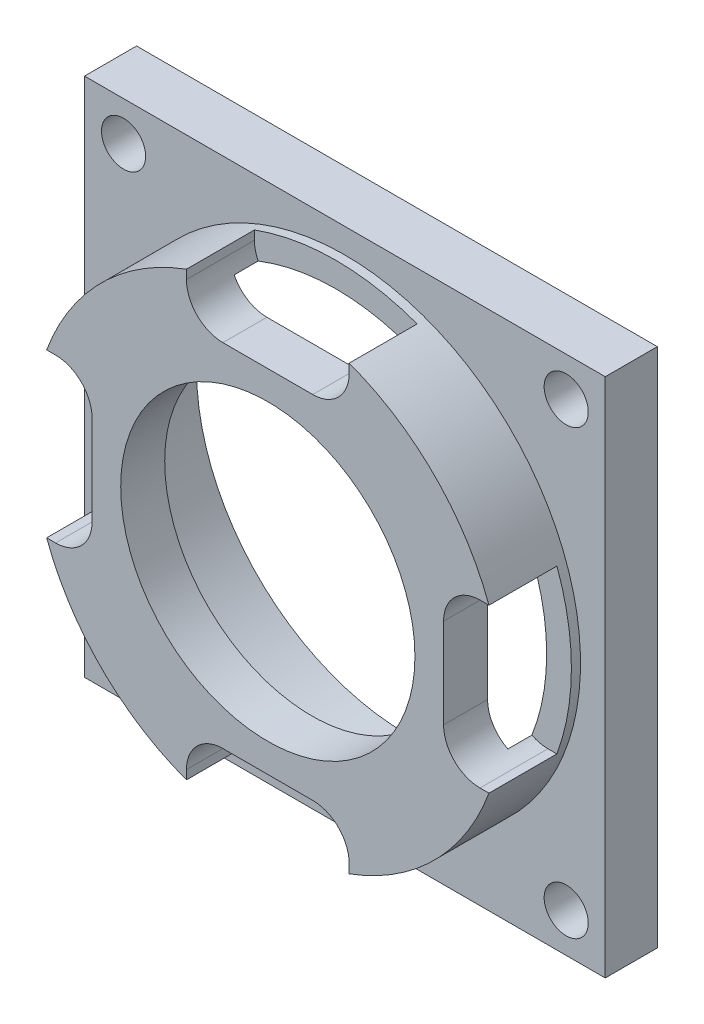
ISO-10303-21;
HEADER;
FILE_DESCRIPTION(('STEP AP214'),'2;1');
FILE_NAME('part.step','',(''),(''),'','','');
FILE_SCHEMA(('AUTOMOTIVE_DESIGN { 1 0 10303 214 1 1 1 1 }'));
ENDSEC;
DATA;
#1=APPLICATION_CONTEXT('core data for automotive mechanical design processes');
#2=APPLICATION_PROTOCOL_DEFINITION('international standard','automotive_design',2000,#1);
#3=PRODUCT_CONTEXT('',#1,'mechanical');
#4=PRODUCT('Part','Part','',(#3));
#5=PRODUCT_RELATED_PRODUCT_CATEGORY('part','',(#4));
#6=PRODUCT_DEFINITION_FORMATION('','',#4);
#7=PRODUCT_DEFINITION_CONTEXT('part definition',#1,'design');
#8=PRODUCT_DEFINITION('design','',#6,#7);
#9=PRODUCT_DEFINITION_SHAPE('','',#8);
#10=(LENGTH_UNIT() NAMED_UNIT(*) SI_UNIT(.MILLI.,.METRE.));
#11=(NAMED_UNIT(*) PLANE_ANGLE_UNIT() SI_UNIT($,.RADIAN.));
#12=(NAMED_UNIT(*) SI_UNIT($,.STERADIAN.) SOLID_ANGLE_UNIT());
#13=UNCERTAINTY_MEASURE_WITH_UNIT(LENGTH_MEASURE(1.E-05),#10,'distance_accuracy_value','');
#14=(GEOMETRIC_REPRESENTATION_CONTEXT(3) GLOBAL_UNCERTAINTY_ASSIGNED_CONTEXT((#13)) GLOBAL_UNIT_ASSIGNED_CONTEXT((#10,
#11,#12)) REPRESENTATION_CONTEXT('',''));
#15=CARTESIAN_POINT('',(0.,0.,0.));
#16=DIRECTION('',(0.,0.,1.));
#17=DIRECTION('',(1.,0.,0.));
#18=AXIS2_PLACEMENT_3D('',#15,#16,#17);
#19=CARTESIAN_POINT('',(0.,0.,24.13));
#20=DIRECTION('',(0.,0.,-1.));
#21=DIRECTION('',(-1.,0.,0.));
#22=AXIS2_PLACEMENT_3D('',#19,#20,#21);
#23=CYLINDRICAL_SURFACE('',#22,22.987);
#24=CARTESIAN_POINT('',(0.,0.,11.3792));
#25=DIRECTION('',(0.,0.,-1.));
#26=DIRECTION('',(-1.,0.,0.));
#27=AXIS2_PLACEMENT_3D('',#24,#25,#26);
#28=CIRCLE('',#27,22.987);
#29=CARTESIAN_POINT('',(-7.93749999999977,21.5730911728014,11.3792));
#30=VERTEX_POINT('',#29);
#31=CARTESIAN_POINT('',(7.93750000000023,21.5730911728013,11.3792));
#32=VERTEX_POINT('',#31);
#33=EDGE_CURVE('E274',#30,#32,#28,.T.);
#34=ORIENTED_EDGE('',*,*,#33,.T.);
#35=DIRECTION('',(0.,0.,-1.));
#36=VECTOR('',#35,1.);
#37=CARTESIAN_POINT('',(7.93750000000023,21.5730911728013,24.13));
#38=LINE('',#37,#36);
#39=CARTESIAN_POINT('',(7.93750000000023,21.5730911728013,18.0086));
#40=VERTEX_POINT('',#39);
#41=EDGE_CURVE('E287',#32,#40,#38,.F.);
#42=ORIENTED_EDGE('',*,*,#41,.T.);
#43=CARTESIAN_POINT('',(0.,0.,18.0086));
#44=DIRECTION('',(0.,0.,-1.));
#45=DIRECTION('',(-1.,0.,0.));
#46=AXIS2_PLACEMENT_3D('',#43,#44,#45);
#47=CIRCLE('',#46,22.987);
#48=CARTESIAN_POINT('',(21.5730911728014,7.9375,18.0086));
#49=VERTEX_POINT('',#48);
#50=EDGE_CURVE('E433',#40,#49,#47,.T.);
#51=ORIENTED_EDGE('',*,*,#50,.T.);
#52=DIRECTION('',(0.,0.,-1.));
#53=VECTOR('',#52,1.);
#54=CARTESIAN_POINT('',(21.5730911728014,7.9375,24.13));
#55=LINE('',#54,#53);
#56=CARTESIAN_POINT('',(21.5730911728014,7.9375,11.3792));
#57=VERTEX_POINT('',#56);
#58=EDGE_CURVE('E363',#49,#57,#55,.T.);
#59=ORIENTED_EDGE('',*,*,#58,.T.);
#60=CARTESIAN_POINT('',(0.,0.,11.3792));
#61=DIRECTION('',(0.,0.,-1.));
#62=DIRECTION('',(-1.,0.,0.));
#63=AXIS2_PLACEMENT_3D('',#60,#61,#62);
#64=CIRCLE('',#63,22.987);
#65=CARTESIAN_POINT('',(21.5730911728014,-7.9375,11.3792));
#66=VERTEX_POINT('',#65);
#67=EDGE_CURVE('E369',#57,#66,#64,.T.);
#68=ORIENTED_EDGE('',*,*,#67,.T.);
#69=DIRECTION('',(0.,0.,-1.));
#70=VECTOR('',#69,1.);
#71=CARTESIAN_POINT('',(21.5730911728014,-7.9375,24.13));
#72=LINE('',#71,#70);
#73=CARTESIAN_POINT('',(21.5730911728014,-7.9375,18.0086));
#74=VERTEX_POINT('',#73);
#75=EDGE_CURVE('E366',#66,#74,#72,.F.);
#76=ORIENTED_EDGE('',*,*,#75,.T.);
#77=CARTESIAN_POINT('',(7.93749999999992,-21.5730911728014,18.0086));
#78=VERTEX_POINT('',#77);
#79=EDGE_CURVE('E428',#74,#78,#47,.T.);
#80=ORIENTED_EDGE('',*,*,#79,.T.);
#81=DIRECTION('',(0.,0.,-1.));
#82=VECTOR('',#81,1.);
#83=CARTESIAN_POINT('',(7.93749999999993,-21.5730911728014,24.13));
#84=LINE('',#83,#82);
#85=CARTESIAN_POINT('',(7.93749999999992,-21.5730911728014,11.3792));
#86=VERTEX_POINT('',#85);
#87=EDGE_CURVE('E341',#78,#86,#84,.T.);
#88=ORIENTED_EDGE('',*,*,#87,.T.);
#89=CARTESIAN_POINT('',(0.,0.,11.3792));
#90=DIRECTION('',(0.,0.,-1.));
#91=DIRECTION('',(-1.,0.,0.));
#92=AXIS2_PLACEMENT_3D('',#89,#90,#91);
#93=CIRCLE('',#92,22.987);
#94=CARTESIAN_POINT('',(-7.93750000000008,-21.5730911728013,11.3792));
#95=VERTEX_POINT('',#94);
#96=EDGE_CURVE('E347',#86,#95,#93,.T.);
#97=ORIENTED_EDGE('',*,*,#96,.T.);
#98=DIRECTION('',(0.,0.,-1.));
#99=VECTOR('',#98,1.);
#100=CARTESIAN_POINT('',(-7.93750000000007,-21.5730911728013,24.13));
#101=LINE('',#100,#99);
#102=CARTESIAN_POINT('',(-7.93750000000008,-21.5730911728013,18.0086));
#103=VERTEX_POINT('',#102);
#104=EDGE_CURVE('E344',#95,#103,#101,.F.);
#105=ORIENTED_EDGE('',*,*,#104,.T.);
#106=CARTESIAN_POINT('',(-21.5730911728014,-7.93749999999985,18.0086));
#107=VERTEX_POINT('',#106);
#108=EDGE_CURVE('E432',#103,#107,#47,.T.);
#109=ORIENTED_EDGE('',*,*,#108,.T.);
#110=DIRECTION('',(0.,0.,-1.));
#111=VECTOR('',#110,1.);
#112=CARTESIAN_POINT('',(-21.5730911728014,-7.93749999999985,24.13));
#113=LINE('',#112,#111);
#114=CARTESIAN_POINT('',(-21.5730911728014,-7.93749999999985,11.3792));
#115=VERTEX_POINT('',#114);
#116=EDGE_CURVE('E320',#107,#115,#113,.T.);
#117=ORIENTED_EDGE('',*,*,#116,.T.);
#118=CARTESIAN_POINT('',(0.,0.,11.3792));
#119=DIRECTION('',(0.,0.,-1.));
#120=DIRECTION('',(-1.,0.,0.));
#121=AXIS2_PLACEMENT_3D('',#118,#119,#120);
#122=CIRCLE('',#121,22.987);
#123=CARTESIAN_POINT('',(-21.5730911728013,7.93750000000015,11.3792));
#124=VERTEX_POINT('',#123);
#125=EDGE_CURVE('E325',#115,#124,#122,.T.);
#126=ORIENTED_EDGE('',*,*,#125,.T.);
#127=DIRECTION('',(0.,0.,-1.));
#128=VECTOR('',#127,1.);
#129=CARTESIAN_POINT('',(-21.5730911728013,7.93750000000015,24.13));
#130=LINE('',#129,#128);
#131=CARTESIAN_POINT('',(-21.5730911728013,7.93750000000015,18.0086));
#132=VERTEX_POINT('',#131);
#133=EDGE_CURVE('E323',#124,#132,#130,.F.);
#134=ORIENTED_EDGE('',*,*,#133,.T.);
#135=CARTESIAN_POINT('',(-7.93749999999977,21.5730911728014,18.0086));
#136=VERTEX_POINT('',#135);
#137=EDGE_CURVE('E302',#132,#136,#47,.T.);
#138=ORIENTED_EDGE('',*,*,#137,.T.);
#139=DIRECTION('',(0.,0.,-1.));
#140=VECTOR('',#139,1.);
#141=CARTESIAN_POINT('',(-7.93749999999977,21.5730911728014,24.13));
#142=LINE('',#141,#140);
#143=EDGE_CURVE('E293',#136,#30,#142,.T.);
#144=ORIENTED_EDGE('',*,*,#143,.T.);
#145=EDGE_LOOP('',(#34,#42,#51,#59,#68,#76,#80,#88,#97,#105,#109,#117,#126,#134,#138,#144));
#146=FACE_BOUND('',#145,.T.);
#147=CARTESIAN_POINT('',(0.,0.,10.4902));
#148=DIRECTION('',(0.,0.,-1.));
#149=DIRECTION('',(-1.,0.,0.));
#150=AXIS2_PLACEMENT_3D('',#147,#148,#149);
#151=CIRCLE('',#150,22.987);
#152=CARTESIAN_POINT('',(-22.987,0.,10.4902));
#153=VERTEX_POINT('',#152);
#154=EDGE_CURVE('E436',#153,#153,#151,.T.);
#155=ORIENTED_EDGE('',*,*,#154,.F.);
#156=EDGE_LOOP('',(#155));
#157=FACE_BOUND('',#156,.T.);
#158=ADVANCED_FACE('F42',(#146,#157),#23,.T.);
#159=CARTESIAN_POINT('',(0.,0.,13.716));
#160=DIRECTION('',(0.,0.,-1.));
#161=DIRECTION('',(-1.,0.,0.));
#162=AXIS2_PLACEMENT_3D('',#159,#160,#161);
#163=PLANE('',#162);
#164=DIRECTION('',(-1.,0.,0.));
#165=VECTOR('',#164,1.);
#166=CARTESIAN_POINT('',(1.79584446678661E-13,17.145,13.716));
#167=LINE('',#166,#165);
#168=CARTESIAN_POINT('',(4.38150000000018,17.145,13.716));
#169=VERTEX_POINT('',#168);
#170=CARTESIAN_POINT('',(-4.38149999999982,17.145,13.716));
#171=VERTEX_POINT('',#170);
#172=EDGE_CURVE('E297',#169,#171,#167,.T.);
#173=ORIENTED_EDGE('',*,*,#172,.F.);
#174=CARTESIAN_POINT('',(4.38150000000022,20.701,13.716));
#175=DIRECTION('',(0.,0.,-1.));
#176=DIRECTION('',(-1.,0.,0.));
#177=AXIS2_PLACEMENT_3D('',#174,#175,#176);
#178=CIRCLE('',#177,3.556);
#179=CARTESIAN_POINT('',(7.57168398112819,19.1300569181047,13.716));
#180=VERTEX_POINT('',#179);
#181=EDGE_CURVE('E572',#169,#180,#178,.F.);
#182=ORIENTED_EDGE('',*,*,#181,.T.);
#183=CARTESIAN_POINT('',(0.,0.,13.716));
#184=DIRECTION('',(0.,0.,-1.));
#185=DIRECTION('',(-1.,0.,0.));
#186=AXIS2_PLACEMENT_3D('',#183,#184,#185);
#187=CIRCLE('',#186,20.574);
#188=CARTESIAN_POINT('',(19.1300569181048,7.57168398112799,13.716));
#189=VERTEX_POINT('',#188);
#190=EDGE_CURVE('E64',#180,#189,#187,.T.);
#191=ORIENTED_EDGE('',*,*,#190,.T.);
#192=CARTESIAN_POINT('',(20.701,4.3815,13.716));
#193=DIRECTION('',(0.,0.,-1.));
#194=DIRECTION('',(-1.,0.,0.));
#195=AXIS2_PLACEMENT_3D('',#192,#193,#194);
#196=CIRCLE('',#195,3.556);
#197=CARTESIAN_POINT('',(17.145,4.3815,13.716));
#198=VERTEX_POINT('',#197);
#199=EDGE_CURVE('E485',#189,#198,#196,.F.);
#200=ORIENTED_EDGE('',*,*,#199,.T.);
#201=DIRECTION('',(0.,1.,0.));
#202=VECTOR('',#201,1.);
#203=CARTESIAN_POINT('',(17.145,0.,13.716));
#204=LINE('',#203,#202);
#205=CARTESIAN_POINT('',(17.145,-4.3815,13.716));
#206=VERTEX_POINT('',#205);
#207=EDGE_CURVE('E360',#206,#198,#204,.T.);
#208=ORIENTED_EDGE('',*,*,#207,.F.);
#209=CARTESIAN_POINT('',(20.701,-4.3815,13.716));
#210=DIRECTION('',(0.,0.,-1.));
#211=DIRECTION('',(-1.,0.,0.));
#212=AXIS2_PLACEMENT_3D('',#209,#210,#211);
#213=CIRCLE('',#212,3.556);
#214=CARTESIAN_POINT('',(19.1300569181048,-7.57168398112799,13.716));
#215=VERTEX_POINT('',#214);
#216=EDGE_CURVE('E476',#206,#215,#213,.F.);
#217=ORIENTED_EDGE('',*,*,#216,.T.);
#218=CARTESIAN_POINT('',(7.57168398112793,-19.1300569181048,13.716));
#219=VERTEX_POINT('',#218);
#220=EDGE_CURVE('E434',#215,#219,#187,.T.);
#221=ORIENTED_EDGE('',*,*,#220,.T.);
#222=CARTESIAN_POINT('',(4.38149999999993,-20.701,13.716));
#223=DIRECTION('',(0.,0.,-1.));
#224=DIRECTION('',(-1.,0.,0.));
#225=AXIS2_PLACEMENT_3D('',#222,#223,#224);
#226=CIRCLE('',#225,3.556);
#227=CARTESIAN_POINT('',(4.38149999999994,-17.145,13.716));
#228=VERTEX_POINT('',#227);
#229=EDGE_CURVE('E528',#219,#228,#226,.F.);
#230=ORIENTED_EDGE('',*,*,#229,.T.);
#231=DIRECTION('',(1.,0.,0.));
#232=VECTOR('',#231,1.);
#233=CARTESIAN_POINT('',(0.,-17.145,13.716));
#234=LINE('',#233,#232);
#235=CARTESIAN_POINT('',(-4.38150000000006,-17.145,13.716));
#236=VERTEX_POINT('',#235);
#237=EDGE_CURVE('E338',#236,#228,#234,.T.);
#238=ORIENTED_EDGE('',*,*,#237,.F.);
#239=CARTESIAN_POINT('',(-4.38150000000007,-20.701,13.716));
#240=DIRECTION('',(0.,0.,-1.));
#241=DIRECTION('',(-1.,0.,0.));
#242=AXIS2_PLACEMENT_3D('',#239,#240,#241);
#243=CIRCLE('',#242,3.556);
#244=CARTESIAN_POINT('',(-7.57168398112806,-19.1300569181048,13.716));
#245=VERTEX_POINT('',#244);
#246=EDGE_CURVE('E518',#236,#245,#243,.F.);
#247=ORIENTED_EDGE('',*,*,#246,.T.);
#248=CARTESIAN_POINT('',(-19.1300569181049,-7.57168398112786,13.716));
#249=VERTEX_POINT('',#248);
#250=EDGE_CURVE('E437',#245,#249,#187,.T.);
#251=ORIENTED_EDGE('',*,*,#250,.T.);
#252=CARTESIAN_POINT('',(-20.701,-4.38149999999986,13.716));
#253=DIRECTION('',(0.,0.,-1.));
#254=DIRECTION('',(-1.,0.,0.));
#255=AXIS2_PLACEMENT_3D('',#252,#253,#254);
#256=CIRCLE('',#255,3.556);
#257=CARTESIAN_POINT('',(-17.145,-4.38149999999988,13.716));
#258=VERTEX_POINT('',#257);
#259=EDGE_CURVE('E555',#249,#258,#256,.F.);
#260=ORIENTED_EDGE('',*,*,#259,.T.);
#261=DIRECTION('',(0.,-1.,0.));
#262=VECTOR('',#261,1.);
#263=CARTESIAN_POINT('',(-17.145,1.19722964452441E-13,13.716));
#264=LINE('',#263,#262);
#265=CARTESIAN_POINT('',(-17.145,4.38150000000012,13.716));
#266=VERTEX_POINT('',#265);
#267=EDGE_CURVE('E317',#266,#258,#264,.T.);
#268=ORIENTED_EDGE('',*,*,#267,.F.);
#269=CARTESIAN_POINT('',(-20.701,4.38150000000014,13.716));
#270=DIRECTION('',(0.,0.,-1.));
#271=DIRECTION('',(-1.,0.,0.));
#272=AXIS2_PLACEMENT_3D('',#269,#270,#271);
#273=CIRCLE('',#272,3.556);
#274=CARTESIAN_POINT('',(-19.1300569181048,7.57168398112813,13.716));
#275=VERTEX_POINT('',#274);
#276=EDGE_CURVE('E546',#266,#275,#273,.F.);
#277=ORIENTED_EDGE('',*,*,#276,.T.);
#278=CARTESIAN_POINT('',(-7.57168398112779,19.1300569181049,13.716));
#279=VERTEX_POINT('',#278);
#280=EDGE_CURVE('E56',#275,#279,#187,.T.);
#281=ORIENTED_EDGE('',*,*,#280,.T.);
#282=CARTESIAN_POINT('',(-4.38149999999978,20.701,13.716));
#283=DIRECTION('',(0.,0.,-1.));
#284=DIRECTION('',(-1.,0.,0.));
#285=AXIS2_PLACEMENT_3D('',#282,#283,#284);
#286=CIRCLE('',#285,3.556);
#287=EDGE_CURVE('E13',#279,#171,#286,.F.);
#288=ORIENTED_EDGE('',*,*,#287,.T.);
#289=EDGE_LOOP('',(#173,#182,#191,#200,#208,#217,#221,#230,#238,#247,#251,#260,#268,#277,#281,#288));
#290=FACE_BOUND('',#289,.T.);
#291=CARTESIAN_POINT('',(0.,0.,13.716));
#292=DIRECTION('',(0.,0.,-1.));
#293=DIRECTION('',(-1.,0.,0.));
#294=AXIS2_PLACEMENT_3D('',#291,#292,#293);
#295=CIRCLE('',#294,14.351);
#296=CARTESIAN_POINT('',(-14.351,0.,13.716));
#297=VERTEX_POINT('',#296);
#298=EDGE_CURVE('E431',#297,#297,#295,.F.);
#299=ORIENTED_EDGE('',*,*,#298,.T.);
#300=EDGE_LOOP('',(#299));
#301=FACE_BOUND('',#300,.T.);
#302=ADVANCED_FACE('F584',(#290,#301),#163,.T.);
#303=CARTESIAN_POINT('',(0.,0.,5.4102));
#304=DIRECTION('',(0.,0.,-1.));
#305=DIRECTION('',(-1.,0.,0.));
#306=AXIS2_PLACEMENT_3D('',#303,#304,#305);
#307=CIRCLE('',#306,22.987);
#308=CARTESIAN_POINT('',(-22.987,0.,5.4102));
#309=VERTEX_POINT('',#308);
#310=EDGE_CURVE('E388',#309,#309,#307,.T.);
#311=CARTESIAN_POINT('',(0.,0.,4.3942));
#312=DIRECTION('',(0.,0.,1.));
#313=DIRECTION('',(1.,0.,0.));
#314=AXIS2_PLACEMENT_3D('',#311,#312,#313);
#315=CIRCLE('',#314,22.987);
#316=CARTESIAN_POINT('',(-22.987,0.,4.3942));
#317=VERTEX_POINT('',#316);
#318=EDGE_CURVE('E424',#317,#317,#315,.T.);
#319=CARTESIAN_POINT('',(-22.987,0.,5.4102));
#320=CARTESIAN_POINT('',(-22.987,0.,5.39961666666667));
#321=CARTESIAN_POINT('',(-22.987,0.,5.38903333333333));
#322=CARTESIAN_POINT('',(-22.987,0.,5.36786666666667));
#323=CARTESIAN_POINT('',(-22.987,0.,5.35728333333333));
#324=CARTESIAN_POINT('',(-22.987,0.,5.33611666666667));
#325=CARTESIAN_POINT('',(-22.987,0.,5.32553333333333));
#326=CARTESIAN_POINT('',(-22.987,0.,5.30436666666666));
#327=CARTESIAN_POINT('',(-22.987,0.,5.29378333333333));
#328=CARTESIAN_POINT('',(-22.987,0.,5.27261666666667));
#329=CARTESIAN_POINT('',(-22.987,0.,5.26203333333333));
#330=CARTESIAN_POINT('',(-22.987,0.,5.24086666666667));
#331=CARTESIAN_POINT('',(-22.987,0.,5.23028333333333));
#332=CARTESIAN_POINT('',(-22.987,0.,5.20911666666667));
#333=CARTESIAN_POINT('',(-22.987,0.,5.19853333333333));
#334=CARTESIAN_POINT('',(-22.987,0.,5.17736666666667));
#335=CARTESIAN_POINT('',(-22.987,0.,5.16678333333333));
#336=CARTESIAN_POINT('',(-22.987,0.,5.14561666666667));
#337=CARTESIAN_POINT('',(-22.987,0.,5.13503333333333));
#338=CARTESIAN_POINT('',(-22.987,0.,5.11386666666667));
#339=CARTESIAN_POINT('',(-22.987,0.,5.10328333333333));
#340=CARTESIAN_POINT('',(-22.987,0.,5.08211666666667));
#341=CARTESIAN_POINT('',(-22.987,0.,5.07153333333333));
#342=CARTESIAN_POINT('',(-22.987,0.,5.05036666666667));
#343=CARTESIAN_POINT('',(-22.987,0.,5.03978333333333));
#344=CARTESIAN_POINT('',(-22.987,0.,5.01861666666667));
#345=CARTESIAN_POINT('',(-22.987,0.,5.00803333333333));
#346=CARTESIAN_POINT('',(-22.987,0.,4.98686666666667));
#347=CARTESIAN_POINT('',(-22.987,0.,4.97628333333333));
#348=CARTESIAN_POINT('',(-22.987,0.,4.95511666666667));
#349=CARTESIAN_POINT('',(-22.987,0.,4.94453333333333));
#350=CARTESIAN_POINT('',(-22.987,0.,4.92336666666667));
#351=CARTESIAN_POINT('',(-22.987,0.,4.91278333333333));
#352=CARTESIAN_POINT('',(-22.987,0.,4.89161666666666));
#353=CARTESIAN_POINT('',(-22.987,0.,4.88103333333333));
#354=CARTESIAN_POINT('',(-22.987,0.,4.85986666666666));
#355=CARTESIAN_POINT('',(-22.987,0.,4.84928333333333));
#356=CARTESIAN_POINT('',(-22.987,0.,4.82811666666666));
#357=CARTESIAN_POINT('',(-22.987,0.,4.81753333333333));
#358=CARTESIAN_POINT('',(-22.987,0.,4.79636666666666));
#359=CARTESIAN_POINT('',(-22.987,0.,4.78578333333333));
#360=CARTESIAN_POINT('',(-22.987,0.,4.76461666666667));
#361=CARTESIAN_POINT('',(-22.987,0.,4.75403333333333));
#362=CARTESIAN_POINT('',(-22.987,0.,4.73286666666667));
#363=CARTESIAN_POINT('',(-22.987,0.,4.72228333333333));
#364=CARTESIAN_POINT('',(-22.987,0.,4.70111666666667));
#365=CARTESIAN_POINT('',(-22.987,0.,4.69053333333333));
#366=CARTESIAN_POINT('',(-22.987,0.,4.66936666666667));
#367=CARTESIAN_POINT('',(-22.987,0.,4.65878333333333));
#368=CARTESIAN_POINT('',(-22.987,0.,4.63761666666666));
#369=CARTESIAN_POINT('',(-22.987,0.,4.62703333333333));
#370=CARTESIAN_POINT('',(-22.987,0.,4.60586666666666));
#371=CARTESIAN_POINT('',(-22.987,0.,4.59528333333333));
#372=CARTESIAN_POINT('',(-22.987,0.,4.57411666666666));
#373=CARTESIAN_POINT('',(-22.987,0.,4.56353333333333));
#374=CARTESIAN_POINT('',(-22.987,0.,4.54236666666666));
#375=CARTESIAN_POINT('',(-22.987,0.,4.53178333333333));
#376=CARTESIAN_POINT('',(-22.987,0.,4.51061666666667));
#377=CARTESIAN_POINT('',(-22.987,0.,4.50003333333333));
#378=CARTESIAN_POINT('',(-22.987,0.,4.47886666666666));
#379=CARTESIAN_POINT('',(-22.987,0.,4.46828333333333));
#380=CARTESIAN_POINT('',(-22.987,0.,4.44711666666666));
#381=CARTESIAN_POINT('',(-22.987,0.,4.43653333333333));
#382=CARTESIAN_POINT('',(-22.987,0.,4.41536666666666));
#383=CARTESIAN_POINT('',(-22.987,0.,4.40478333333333));
#384=CARTESIAN_POINT('',(-22.987,0.,4.3942));
#385=B_SPLINE_CURVE_WITH_KNOTS('',3,(#319,#320,#321,#322,#323,#324,#325,#326,#327,#328,#329,
#330,#331,#332,#333,#334,#335,#336,#337,#338,#339,#340,#341,#342,#343,#344,#345,#346,#347,#348,
#349,#350,#351,#352,#353,#354,#355,#356,#357,#358,#359,#360,#361,#362,#363,#364,#365,#366,#367,
#368,#369,#370,#371,#372,#373,#374,#375,#376,#377,#378,#379,#380,#381,#382,#383,#384),
.UNSPECIFIED.,.F.,.F.,(4,2,2,2,2,2,2,2,2,2,2,2,2,2,2,2,2,2,2,2,2,2,2,2,2,2,2,2,2,2,2,2,4),(0.,
0.0317500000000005,0.0635000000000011,0.0952500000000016,0.127000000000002,0.158749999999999,
0.1905,0.22225,0.254000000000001,0.285750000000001,0.317500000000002,0.349250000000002,
0.380999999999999,0.41275,0.4445,0.476250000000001,0.508000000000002,0.539750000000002,
0.571500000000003,0.603250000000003,0.635000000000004,0.666750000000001,0.698500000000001,
0.730250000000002,0.762000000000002,0.793750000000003,0.825500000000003,0.857250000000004,
0.889000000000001,0.920750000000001,0.952500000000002,0.984250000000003,1.016),.UNSPECIFIED.);
#386=EDGE_CURVE('BSEAM44',#309,#317,#385,.T.);
#387=ORIENTED_EDGE('',*,*,#310,.T.);
#388=ORIENTED_EDGE('',*,*,#318,.T.);
#389=ORIENTED_EDGE('',*,*,#386,.T.);
#390=ORIENTED_EDGE('',*,*,#386,.F.);
#391=EDGE_LOOP('',(#387,#389,#388,#390));
#392=FACE_BOUND('',#391,.T.);
#393=ADVANCED_FACE('F44',(#392),#23,.T.);
#394=CARTESIAN_POINT('',(0.,0.,13.716));
#395=DIRECTION('',(0.,0.,-1.));
#396=DIRECTION('',(-1.,0.,0.));
#397=AXIS2_PLACEMENT_3D('',#394,#395,#396);
#398=CYLINDRICAL_SURFACE('',#397,20.574);
#399=CARTESIAN_POINT('',(0.,0.,4.3942));
#400=DIRECTION('',(0.,0.,1.));
#401=DIRECTION('',(1.,0.,0.));
#402=AXIS2_PLACEMENT_3D('',#399,#400,#401);
#403=CIRCLE('',#402,20.574);
#404=CARTESIAN_POINT('',(20.574,0.,4.3942));
#405=VERTEX_POINT('',#404);
#406=EDGE_CURVE('E418',#405,#405,#403,.F.);
#407=ORIENTED_EDGE('',*,*,#406,.T.);
#408=EDGE_LOOP('',(#407));
#409=FACE_BOUND('',#408,.T.);
#410=ORIENTED_EDGE('',*,*,#190,.F.);
#411=DIRECTION('',(0.,0.,-1.));
#412=VECTOR('',#411,1.);
#413=CARTESIAN_POINT('',(7.57168398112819,19.1300569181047,13.716));
#414=LINE('',#413,#412);
#415=CARTESIAN_POINT('',(7.57168398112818,19.1300569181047,11.3792));
#416=VERTEX_POINT('',#415);
#417=EDGE_CURVE('E574',#180,#416,#414,.T.);
#418=ORIENTED_EDGE('',*,*,#417,.T.);
#419=CARTESIAN_POINT('',(0.,0.,11.3792));
#420=DIRECTION('',(0.,0.,-1.));
#421=DIRECTION('',(-1.,0.,0.));
#422=AXIS2_PLACEMENT_3D('',#419,#420,#421);
#423=CIRCLE('',#422,20.574);
#424=CARTESIAN_POINT('',(-7.57168398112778,19.1300569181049,11.3792));
#425=VERTEX_POINT('',#424);
#426=EDGE_CURVE('E499',#416,#425,#423,.F.);
#427=ORIENTED_EDGE('',*,*,#426,.T.);
#428=DIRECTION('',(0.,0.,-1.));
#429=VECTOR('',#428,1.);
#430=CARTESIAN_POINT('',(-7.57168398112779,19.1300569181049,11.3792));
#431=LINE('',#430,#429);
#432=EDGE_CURVE('E50',#425,#279,#431,.F.);
#433=ORIENTED_EDGE('',*,*,#432,.T.);
#434=ORIENTED_EDGE('',*,*,#280,.F.);
#435=DIRECTION('',(0.,0.,-1.));
#436=VECTOR('',#435,1.);
#437=CARTESIAN_POINT('',(-19.1300569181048,7.57168398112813,13.716));
#438=LINE('',#437,#436);
#439=CARTESIAN_POINT('',(-19.1300569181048,7.57168398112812,11.3792));
#440=VERTEX_POINT('',#439);
#441=EDGE_CURVE('E548',#275,#440,#438,.T.);
#442=ORIENTED_EDGE('',*,*,#441,.T.);
#443=CARTESIAN_POINT('',(0.,0.,11.3792));
#444=DIRECTION('',(0.,0.,-1.));
#445=DIRECTION('',(-1.,0.,0.));
#446=AXIS2_PLACEMENT_3D('',#443,#444,#445);
#447=CIRCLE('',#446,20.574);
#448=CARTESIAN_POINT('',(-19.1300569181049,-7.57168398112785,11.3792));
#449=VERTEX_POINT('',#448);
#450=EDGE_CURVE('E494',#440,#449,#447,.F.);
#451=ORIENTED_EDGE('',*,*,#450,.T.);
#452=DIRECTION('',(0.,0.,-1.));
#453=VECTOR('',#452,1.);
#454=CARTESIAN_POINT('',(-19.1300569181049,-7.57168398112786,11.3792));
#455=LINE('',#454,#453);
#456=EDGE_CURVE('E552',#449,#249,#455,.F.);
#457=ORIENTED_EDGE('',*,*,#456,.T.);
#458=ORIENTED_EDGE('',*,*,#250,.F.);
#459=DIRECTION('',(0.,0.,-1.));
#460=VECTOR('',#459,1.);
#461=CARTESIAN_POINT('',(-7.57168398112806,-19.1300569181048,13.716));
#462=LINE('',#461,#460);
#463=CARTESIAN_POINT('',(-7.57168398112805,-19.1300569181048,11.3792));
#464=VERTEX_POINT('',#463);
#465=EDGE_CURVE('E521',#245,#464,#462,.T.);
#466=ORIENTED_EDGE('',*,*,#465,.T.);
#467=CARTESIAN_POINT('',(0.,0.,11.3792));
#468=DIRECTION('',(0.,0.,-1.));
#469=DIRECTION('',(-1.,0.,0.));
#470=AXIS2_PLACEMENT_3D('',#467,#468,#469);
#471=CIRCLE('',#470,20.574);
#472=CARTESIAN_POINT('',(7.57168398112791,-19.1300569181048,11.3792));
#473=VERTEX_POINT('',#472);
#474=EDGE_CURVE('E489',#464,#473,#471,.F.);
#475=ORIENTED_EDGE('',*,*,#474,.T.);
#476=DIRECTION('',(0.,0.,-1.));
#477=VECTOR('',#476,1.);
#478=CARTESIAN_POINT('',(7.57168398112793,-19.1300569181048,11.3792));
#479=LINE('',#478,#477);
#480=EDGE_CURVE('E525',#473,#219,#479,.F.);
#481=ORIENTED_EDGE('',*,*,#480,.T.);
#482=ORIENTED_EDGE('',*,*,#220,.F.);
#483=DIRECTION('',(0.,0.,-1.));
#484=VECTOR('',#483,1.);
#485=CARTESIAN_POINT('',(19.1300569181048,-7.57168398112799,13.716));
#486=LINE('',#485,#484);
#487=CARTESIAN_POINT('',(19.1300569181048,-7.57168398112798,11.3792));
#488=VERTEX_POINT('',#487);
#489=EDGE_CURVE('E479',#215,#488,#486,.T.);
#490=ORIENTED_EDGE('',*,*,#489,.T.);
#491=CARTESIAN_POINT('',(0.,0.,11.3792));
#492=DIRECTION('',(0.,0.,-1.));
#493=DIRECTION('',(-1.,0.,0.));
#494=AXIS2_PLACEMENT_3D('',#491,#492,#493);
#495=CIRCLE('',#494,20.574);
#496=CARTESIAN_POINT('',(19.1300569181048,7.57168398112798,11.3792));
#497=VERTEX_POINT('',#496);
#498=EDGE_CURVE('E457',#488,#497,#495,.F.);
#499=ORIENTED_EDGE('',*,*,#498,.T.);
#500=DIRECTION('',(0.,0.,-1.));
#501=VECTOR('',#500,1.);
#502=CARTESIAN_POINT('',(19.1300569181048,7.57168398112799,11.3792));
#503=LINE('',#502,#501);
#504=EDGE_CURVE('E483',#497,#189,#503,.F.);
#505=ORIENTED_EDGE('',*,*,#504,.T.);
#506=EDGE_LOOP('',(#410,#418,#427,#433,#434,#442,#451,#457,#458,#466,#475,#481,#482,#490,#499,#505));
#507=FACE_BOUND('',#506,.T.);
#508=ADVANCED_FACE('F579',(#409,#507),#398,.F.);
#509=CARTESIAN_POINT('',(0.,0.,24.13));
#510=DIRECTION('',(0.,0.,-1.));
#511=DIRECTION('',(-1.,0.,0.));
#512=AXIS2_PLACEMENT_3D('',#509,#510,#511);
#513=CYLINDRICAL_SURFACE('',#512,14.351);
#514=CARTESIAN_POINT('',(0.,0.,18.0086));
#515=DIRECTION('',(0.,0.,-1.));
#516=DIRECTION('',(-1.,0.,0.));
#517=AXIS2_PLACEMENT_3D('',#514,#515,#516);
#518=CIRCLE('',#517,14.351);
#519=CARTESIAN_POINT('',(-14.351,0.,18.0086));
#520=VERTEX_POINT('',#519);
#521=EDGE_CURVE('E427',#520,#520,#518,.T.);
#522=CARTESIAN_POINT('',(-14.351,0.,18.0086));
#523=CARTESIAN_POINT('',(-14.351,0.,17.9638854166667));
#524=CARTESIAN_POINT('',(-14.351,0.,17.9191708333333));
#525=CARTESIAN_POINT('',(-14.351,0.,17.8297416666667));
#526=CARTESIAN_POINT('',(-14.351,0.,17.7850270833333));
#527=CARTESIAN_POINT('',(-14.351,0.,17.6955979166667));
#528=CARTESIAN_POINT('',(-14.351,0.,17.6508833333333));
#529=CARTESIAN_POINT('',(-14.351,0.,17.5614541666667));
#530=CARTESIAN_POINT('',(-14.351,0.,17.5167395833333));
#531=CARTESIAN_POINT('',(-14.351,0.,17.4273104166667));
#532=CARTESIAN_POINT('',(-14.351,0.,17.3825958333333));
#533=CARTESIAN_POINT('',(-14.351,0.,17.2931666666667));
#534=CARTESIAN_POINT('',(-14.351,0.,17.2484520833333));
#535=CARTESIAN_POINT('',(-14.351,0.,17.1590229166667));
#536=CARTESIAN_POINT('',(-14.351,0.,17.1143083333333));
#537=CARTESIAN_POINT('',(-14.351,0.,17.0248791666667));
#538=CARTESIAN_POINT('',(-14.351,0.,16.9801645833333));
#539=CARTESIAN_POINT('',(-14.351,0.,16.8907354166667));
#540=CARTESIAN_POINT('',(-14.351,0.,16.8460208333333));
#541=CARTESIAN_POINT('',(-14.351,0.,16.7565916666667));
#542=CARTESIAN_POINT('',(-14.351,0.,16.7118770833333));
#543=CARTESIAN_POINT('',(-14.351,0.,16.6224479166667));
#544=CARTESIAN_POINT('',(-14.351,0.,16.5777333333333));
#545=CARTESIAN_POINT('',(-14.351,0.,16.4883041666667));
#546=CARTESIAN_POINT('',(-14.351,0.,16.4435895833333));
#547=CARTESIAN_POINT('',(-14.351,0.,16.3541604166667));
#548=CARTESIAN_POINT('',(-14.351,0.,16.3094458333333));
#549=CARTESIAN_POINT('',(-14.351,0.,16.2200166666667));
#550=CARTESIAN_POINT('',(-14.351,0.,16.1753020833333));
#551=CARTESIAN_POINT('',(-14.351,0.,16.0858729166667));
#552=CARTESIAN_POINT('',(-14.351,0.,16.0411583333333));
#553=CARTESIAN_POINT('',(-14.351,0.,15.9517291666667));
#554=CARTESIAN_POINT('',(-14.351,0.,15.9070145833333));
#555=CARTESIAN_POINT('',(-14.351,0.,15.8175854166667));
#556=CARTESIAN_POINT('',(-14.351,0.,15.7728708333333));
#557=CARTESIAN_POINT('',(-14.351,0.,15.6834416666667));
#558=CARTESIAN_POINT('',(-14.351,0.,15.6387270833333));
#559=CARTESIAN_POINT('',(-14.351,0.,15.5492979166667));
#560=CARTESIAN_POINT('',(-14.351,0.,15.5045833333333));
#561=CARTESIAN_POINT('',(-14.351,0.,15.4151541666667));
#562=CARTESIAN_POINT('',(-14.351,0.,15.3704395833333));
#563=CARTESIAN_POINT('',(-14.351,0.,15.2810104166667));
#564=CARTESIAN_POINT('',(-14.351,0.,15.2362958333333));
#565=CARTESIAN_POINT('',(-14.351,0.,15.1468666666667));
#566=CARTESIAN_POINT('',(-14.351,0.,15.1021520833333));
#567=CARTESIAN_POINT('',(-14.351,0.,15.0127229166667));
#568=CARTESIAN_POINT('',(-14.351,0.,14.9680083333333));
#569=CARTESIAN_POINT('',(-14.351,0.,14.8785791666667));
#570=CARTESIAN_POINT('',(-14.351,0.,14.8338645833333));
#571=CARTESIAN_POINT('',(-14.351,0.,14.7444354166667));
#572=CARTESIAN_POINT('',(-14.351,0.,14.6997208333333));
#573=CARTESIAN_POINT('',(-14.351,0.,14.6102916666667));
#574=CARTESIAN_POINT('',(-14.351,0.,14.5655770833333));
#575=CARTESIAN_POINT('',(-14.351,0.,14.4761479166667));
#576=CARTESIAN_POINT('',(-14.351,0.,14.4314333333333));
#577=CARTESIAN_POINT('',(-14.351,0.,14.3420041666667));
#578=CARTESIAN_POINT('',(-14.351,0.,14.2972895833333));
#579=CARTESIAN_POINT('',(-14.351,0.,14.2078604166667));
#580=CARTESIAN_POINT('',(-14.351,0.,14.1631458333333));
#581=CARTESIAN_POINT('',(-14.351,0.,14.0737166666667));
#582=CARTESIAN_POINT('',(-14.351,0.,14.0290020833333));
#583=CARTESIAN_POINT('',(-14.351,0.,13.9395729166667));
#584=CARTESIAN_POINT('',(-14.351,0.,13.8948583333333));
#585=CARTESIAN_POINT('',(-14.351,0.,13.8054291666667));
#586=CARTESIAN_POINT('',(-14.351,0.,13.7607145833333));
#587=CARTESIAN_POINT('',(-14.351,0.,13.716));
#588=B_SPLINE_CURVE_WITH_KNOTS('',3,(#522,#523,#524,#525,#526,#527,#528,#529,#530,#531,#532,
#533,#534,#535,#536,#537,#538,#539,#540,#541,#542,#543,#544,#545,#546,#547,#548,#549,#550,#551,
#552,#553,#554,#555,#556,#557,#558,#559,#560,#561,#562,#563,#564,#565,#566,#567,#568,#569,#570,
#571,#572,#573,#574,#575,#576,#577,#578,#579,#580,#581,#582,#583,#584,#585,#586,#587),
.UNSPECIFIED.,.F.,.F.,(4,2,2,2,2,2,2,2,2,2,2,2,2,2,2,2,2,2,2,2,2,2,2,2,2,2,2,2,2,2,2,2,4),(0.,
0.134143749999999,0.268287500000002,0.402431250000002,0.536575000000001,0.67071875,0.8048625,
0.939006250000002,1.07315,1.20729375,1.3414375,1.47558125,1.609725,1.74386875,1.8780125,
2.01215625,2.1463,2.28044375,2.4145875,2.54873125,2.682875,2.81701875,2.9511625,3.08530625,
3.21945,3.35359375,3.4877375,3.62188125,3.756025,3.89016875,4.0243125,4.15845625,4.2926),.UNSPECIFIED.);
#589=EDGE_CURVE('BSEAM710',#520,#297,#588,.T.);
#590=ORIENTED_EDGE('',*,*,#521,.F.);
#591=ORIENTED_EDGE('',*,*,#298,.F.);
#592=ORIENTED_EDGE('',*,*,#589,.T.);
#593=ORIENTED_EDGE('',*,*,#589,.F.);
#594=EDGE_LOOP('',(#590,#592,#591,#593));
#595=FACE_BOUND('',#594,.T.);
#596=ADVANCED_FACE('F710',(#595),#513,.F.);
#597=CARTESIAN_POINT('',(0.,0.,18.0086));
#598=DIRECTION('',(0.,0.,-1.));
#599=DIRECTION('',(-1.,0.,0.));
#600=AXIS2_PLACEMENT_3D('',#597,#598,#599);
#601=PLANE('',#600);
#602=ORIENTED_EDGE('',*,*,#50,.F.);
#603=DIRECTION('',(0.,1.,0.));
#604=VECTOR('',#603,1.);
#605=CARTESIAN_POINT('',(7.93750000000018,17.1449999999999,18.0086));
#606=LINE('',#605,#604);
#607=CARTESIAN_POINT('',(7.93750000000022,20.7009999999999,18.0086));
#608=VERTEX_POINT('',#607);
#609=EDGE_CURVE('E653',#608,#40,#606,.T.);
#610=ORIENTED_EDGE('',*,*,#609,.F.);
#611=CARTESIAN_POINT('',(4.38150000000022,20.701,18.0086));
#612=DIRECTION('',(0.,0.,-1.));
#613=DIRECTION('',(-1.,0.,0.));
#614=AXIS2_PLACEMENT_3D('',#611,#612,#613);
#615=CIRCLE('',#614,3.556);
#616=CARTESIAN_POINT('',(4.38150000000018,17.145,18.0086));
#617=VERTEX_POINT('',#616);
#618=EDGE_CURVE('E570',#608,#617,#615,.T.);
#619=ORIENTED_EDGE('',*,*,#618,.T.);
#620=DIRECTION('',(1.,0.,0.));
#621=VECTOR('',#620,1.);
#622=CARTESIAN_POINT('',(-7.93749999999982,17.1450000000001,18.0086));
#623=LINE('',#622,#621);
#624=CARTESIAN_POINT('',(-4.38149999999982,17.145,18.0086));
#625=VERTEX_POINT('',#624);
#626=EDGE_CURVE('E592',#625,#617,#623,.T.);
#627=ORIENTED_EDGE('',*,*,#626,.F.);
#628=CARTESIAN_POINT('',(-4.38149999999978,20.701,18.0086));
#629=DIRECTION('',(0.,0.,-1.));
#630=DIRECTION('',(-1.,0.,0.));
#631=AXIS2_PLACEMENT_3D('',#628,#629,#630);
#632=CIRCLE('',#631,3.556);
#633=CARTESIAN_POINT('',(-7.93749999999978,20.7010000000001,18.0086));
#634=VERTEX_POINT('',#633);
#635=EDGE_CURVE('E576',#625,#634,#632,.T.);
#636=ORIENTED_EDGE('',*,*,#635,.T.);
#637=DIRECTION('',(0.,1.,0.));
#638=VECTOR('',#637,1.);
#639=CARTESIAN_POINT('',(-7.9375,0.,18.0086));
#640=LINE('',#639,#638);
#641=EDGE_CURVE('E497',#634,#136,#640,.T.);
#642=ORIENTED_EDGE('',*,*,#641,.T.);
#643=ORIENTED_EDGE('',*,*,#137,.F.);
#644=DIRECTION('',(-1.,0.,0.));
#645=VECTOR('',#644,1.);
#646=CARTESIAN_POINT('',(-17.1449999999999,7.93750000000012,18.0086));
#647=LINE('',#646,#645);
#648=CARTESIAN_POINT('',(-20.7009999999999,7.93750000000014,18.0086));
#649=VERTEX_POINT('',#648);
#650=EDGE_CURVE('E308',#649,#132,#647,.T.);
#651=ORIENTED_EDGE('',*,*,#650,.F.);
#652=CARTESIAN_POINT('',(-20.701,4.38150000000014,18.0086));
#653=DIRECTION('',(0.,0.,-1.));
#654=DIRECTION('',(-1.,0.,0.));
#655=AXIS2_PLACEMENT_3D('',#652,#653,#654);
#656=CIRCLE('',#655,3.556);
#657=CARTESIAN_POINT('',(-17.145,4.38150000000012,18.0086));
#658=VERTEX_POINT('',#657);
#659=EDGE_CURVE('E544',#649,#658,#656,.T.);
#660=ORIENTED_EDGE('',*,*,#659,.T.);
#661=DIRECTION('',(0.,1.,0.));
#662=VECTOR('',#661,1.);
#663=CARTESIAN_POINT('',(-17.1450000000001,-7.93749999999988,18.0086));
#664=LINE('',#663,#662);
#665=CARTESIAN_POINT('',(-17.145,-4.38149999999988,18.0086));
#666=VERTEX_POINT('',#665);
#667=EDGE_CURVE('E286',#666,#658,#664,.T.);
#668=ORIENTED_EDGE('',*,*,#667,.F.);
#669=CARTESIAN_POINT('',(-20.701,-4.38149999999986,18.0086));
#670=DIRECTION('',(0.,0.,-1.));
#671=DIRECTION('',(-1.,0.,0.));
#672=AXIS2_PLACEMENT_3D('',#669,#670,#671);
#673=CIRCLE('',#672,3.556);
#674=CARTESIAN_POINT('',(-20.7010000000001,-7.93749999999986,18.0086));
#675=VERTEX_POINT('',#674);
#676=EDGE_CURVE('E550',#666,#675,#673,.T.);
#677=ORIENTED_EDGE('',*,*,#676,.T.);
#678=DIRECTION('',(-1.,0.,0.));
#679=VECTOR('',#678,1.);
#680=CARTESIAN_POINT('',(0.,-7.9375,18.0086));
#681=LINE('',#680,#679);
#682=EDGE_CURVE('E492',#675,#107,#681,.T.);
#683=ORIENTED_EDGE('',*,*,#682,.T.);
#684=ORIENTED_EDGE('',*,*,#108,.F.);
#685=DIRECTION('',(0.,-1.,0.));
#686=VECTOR('',#685,1.);
#687=CARTESIAN_POINT('',(-7.93750000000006,-17.145,18.0086));
#688=LINE('',#687,#686);
#689=CARTESIAN_POINT('',(-7.93750000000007,-20.701,18.0086));
#690=VERTEX_POINT('',#689);
#691=EDGE_CURVE('E329',#690,#103,#688,.T.);
#692=ORIENTED_EDGE('',*,*,#691,.F.);
#693=CARTESIAN_POINT('',(-4.38150000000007,-20.701,18.0086));
#694=DIRECTION('',(0.,0.,-1.));
#695=DIRECTION('',(-1.,0.,0.));
#696=AXIS2_PLACEMENT_3D('',#693,#694,#695);
#697=CIRCLE('',#696,3.556);
#698=CARTESIAN_POINT('',(-4.38150000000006,-17.145,18.0086));
#699=VERTEX_POINT('',#698);
#700=EDGE_CURVE('E516',#690,#699,#697,.T.);
#701=ORIENTED_EDGE('',*,*,#700,.T.);
#702=DIRECTION('',(-1.,0.,0.));
#703=VECTOR('',#702,1.);
#704=CARTESIAN_POINT('',(7.93749999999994,-17.145,18.0086));
#705=LINE('',#704,#703);
#706=CARTESIAN_POINT('',(4.38149999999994,-17.145,18.0086));
#707=VERTEX_POINT('',#706);
#708=EDGE_CURVE('E328',#707,#699,#705,.T.);
#709=ORIENTED_EDGE('',*,*,#708,.F.);
#710=CARTESIAN_POINT('',(4.38149999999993,-20.701,18.0086));
#711=DIRECTION('',(0.,0.,-1.));
#712=DIRECTION('',(-1.,0.,0.));
#713=AXIS2_PLACEMENT_3D('',#710,#711,#712);
#714=CIRCLE('',#713,3.556);
#715=CARTESIAN_POINT('',(7.93749999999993,-20.701,18.0086));
#716=VERTEX_POINT('',#715);
#717=EDGE_CURVE('E523',#707,#716,#714,.T.);
#718=ORIENTED_EDGE('',*,*,#717,.T.);
#719=DIRECTION('',(0.,-1.,0.));
#720=VECTOR('',#719,1.);
#721=CARTESIAN_POINT('',(7.9375,0.,18.0086));
#722=LINE('',#721,#720);
#723=EDGE_CURVE('E487',#716,#78,#722,.T.);
#724=ORIENTED_EDGE('',*,*,#723,.T.);
#725=ORIENTED_EDGE('',*,*,#79,.F.);
#726=DIRECTION('',(1.,0.,0.));
#727=VECTOR('',#726,1.);
#728=CARTESIAN_POINT('',(17.145,-7.9375,18.0086));
#729=LINE('',#728,#727);
#730=CARTESIAN_POINT('',(20.701,-7.9375,18.0086));
#731=VERTEX_POINT('',#730);
#732=EDGE_CURVE('E351',#731,#74,#729,.T.);
#733=ORIENTED_EDGE('',*,*,#732,.F.);
#734=CARTESIAN_POINT('',(20.701,-4.3815,18.0086));
#735=DIRECTION('',(0.,0.,-1.));
#736=DIRECTION('',(-1.,0.,0.));
#737=AXIS2_PLACEMENT_3D('',#734,#735,#736);
#738=CIRCLE('',#737,3.556);
#739=CARTESIAN_POINT('',(17.145,-4.3815,18.0086));
#740=VERTEX_POINT('',#739);
#741=EDGE_CURVE('E474',#731,#740,#738,.T.);
#742=ORIENTED_EDGE('',*,*,#741,.T.);
#743=DIRECTION('',(0.,-1.,0.));
#744=VECTOR('',#743,1.);
#745=CARTESIAN_POINT('',(17.145,7.9375,18.0086));
#746=LINE('',#745,#744);
#747=CARTESIAN_POINT('',(17.145,4.3815,18.0086));
#748=VERTEX_POINT('',#747);
#749=EDGE_CURVE('E350',#748,#740,#746,.T.);
#750=ORIENTED_EDGE('',*,*,#749,.F.);
#751=CARTESIAN_POINT('',(20.701,4.3815,18.0086));
#752=DIRECTION('',(0.,0.,-1.));
#753=DIRECTION('',(-1.,0.,0.));
#754=AXIS2_PLACEMENT_3D('',#751,#752,#753);
#755=CIRCLE('',#754,3.556);
#756=CARTESIAN_POINT('',(20.701,7.9375,18.0086));
#757=VERTEX_POINT('',#756);
#758=EDGE_CURVE('E481',#748,#757,#755,.T.);
#759=ORIENTED_EDGE('',*,*,#758,.T.);
#760=DIRECTION('',(1.,0.,0.));
#761=VECTOR('',#760,1.);
#762=CARTESIAN_POINT('',(0.,7.9375,18.0086));
#763=LINE('',#762,#761);
#764=EDGE_CURVE('E446',#757,#49,#763,.T.);
#765=ORIENTED_EDGE('',*,*,#764,.T.);
#766=EDGE_LOOP('',(#602,#610,#619,#627,#636,#642,#643,#651,#660,#668,#677,#683,#684,#692,#701,
#709,#718,#724,#725,#733,#742,#750,#759,#765));
#767=FACE_BOUND('',#766,.T.);
#768=ORIENTED_EDGE('',*,*,#521,.T.);
#769=EDGE_LOOP('',(#768));
#770=FACE_BOUND('',#769,.T.);
#771=ADVANCED_FACE('F613',(#767,#770),#601,.F.);
#772=CARTESIAN_POINT('',(0.,0.,4.3942));
#773=DIRECTION('',(0.,0.,1.));
#774=DIRECTION('',(1.,0.,0.));
#775=AXIS2_PLACEMENT_3D('',#772,#773,#774);
#776=PLANE('',#775);
#777=ORIENTED_EDGE('',*,*,#406,.F.);
#778=EDGE_LOOP('',(#777));
#779=FACE_BOUND('',#778,.T.);
#780=ORIENTED_EDGE('',*,*,#318,.F.);
#781=EDGE_LOOP('',(#780));
#782=FACE_BOUND('',#781,.T.);
#783=ADVANCED_FACE('F716',(#779,#782),#776,.F.);
#784=CARTESIAN_POINT('',(25.4,25.4,10.4902));
#785=DIRECTION('',(1.,0.,0.));
#786=DIRECTION('',(0.,1.,0.));
#787=AXIS2_PLACEMENT_3D('',#784,#785,#786);
#788=PLANE('',#787);
#789=DIRECTION('',(0.,-1.,0.));
#790=VECTOR('',#789,1.);
#791=CARTESIAN_POINT('',(25.4,25.4,5.4102));
#792=LINE('',#791,#790);
#793=CARTESIAN_POINT('',(25.4,25.4,5.4102));
#794=VERTEX_POINT('',#793);
#795=CARTESIAN_POINT('',(25.4,-25.4,5.4102));
#796=VERTEX_POINT('',#795);
#797=EDGE_CURVE('E391',#794,#796,#792,.T.);
#798=ORIENTED_EDGE('',*,*,#797,.F.);
#799=DIRECTION('',(0.,0.,-1.));
#800=VECTOR('',#799,1.);
#801=CARTESIAN_POINT('',(25.4,25.4,10.4902));
#802=LINE('',#801,#800);
#803=CARTESIAN_POINT('',(25.4,25.4,10.4902));
#804=VERTEX_POINT('',#803);
#805=EDGE_CURVE('E416',#804,#794,#802,.T.);
#806=ORIENTED_EDGE('',*,*,#805,.F.);
#807=DIRECTION('',(0.,-1.,0.));
#808=VECTOR('',#807,1.);
#809=CARTESIAN_POINT('',(25.4,25.4,10.4902));
#810=LINE('',#809,#808);
#811=CARTESIAN_POINT('',(25.4,-25.4,10.4902));
#812=VERTEX_POINT('',#811);
#813=EDGE_CURVE('E403',#804,#812,#810,.T.);
#814=ORIENTED_EDGE('',*,*,#813,.T.);
#815=DIRECTION('',(0.,0.,-1.));
#816=VECTOR('',#815,1.);
#817=CARTESIAN_POINT('',(25.4,-25.4,10.4902));
#818=LINE('',#817,#816);
#819=EDGE_CURVE('E415',#812,#796,#818,.T.);
#820=ORIENTED_EDGE('',*,*,#819,.T.);
#821=EDGE_LOOP('',(#798,#806,#814,#820));
#822=FACE_BOUND('',#821,.T.);
#823=ADVANCED_FACE('F718',(#822),#788,.T.);
#824=CARTESIAN_POINT('',(25.4,25.4,10.4902));
#825=DIRECTION('',(0.,1.,0.));
#826=DIRECTION('',(0.,0.,1.));
#827=AXIS2_PLACEMENT_3D('',#824,#825,#826);
#828=PLANE('',#827);
#829=DIRECTION('',(1.,0.,0.));
#830=VECTOR('',#829,1.);
#831=CARTESIAN_POINT('',(25.4,25.4,5.4102));
#832=LINE('',#831,#830);
#833=CARTESIAN_POINT('',(-25.4,25.4,5.4102));
#834=VERTEX_POINT('',#833);
#835=EDGE_CURVE('E400',#834,#794,#832,.T.);
#836=ORIENTED_EDGE('',*,*,#835,.F.);
#837=DIRECTION('',(0.,0.,-1.));
#838=VECTOR('',#837,1.);
#839=CARTESIAN_POINT('',(-25.4,25.4,10.4902));
#840=LINE('',#839,#838);
#841=CARTESIAN_POINT('',(-25.4,25.4,10.4902));
#842=VERTEX_POINT('',#841);
#843=EDGE_CURVE('E419',#842,#834,#840,.T.);
#844=ORIENTED_EDGE('',*,*,#843,.F.);
#845=DIRECTION('',(1.,0.,0.));
#846=VECTOR('',#845,1.);
#847=CARTESIAN_POINT('',(25.4,25.4,10.4902));
#848=LINE('',#847,#846);
#849=EDGE_CURVE('E412',#842,#804,#848,.T.);
#850=ORIENTED_EDGE('',*,*,#849,.T.);
#851=ORIENTED_EDGE('',*,*,#805,.T.);
#852=EDGE_LOOP('',(#836,#844,#850,#851));
#853=FACE_BOUND('',#852,.T.);
#854=ADVANCED_FACE('F725',(#853),#828,.T.);
#855=CARTESIAN_POINT('',(-25.4,25.4,10.4902));
#856=DIRECTION('',(-1.,0.,0.));
#857=DIRECTION('',(0.,-1.,0.));
#858=AXIS2_PLACEMENT_3D('',#855,#856,#857);
#859=PLANE('',#858);
#860=DIRECTION('',(0.,1.,0.));
#861=VECTOR('',#860,1.);
#862=CARTESIAN_POINT('',(-25.4,25.4,5.4102));
#863=LINE('',#862,#861);
#864=CARTESIAN_POINT('',(-25.4,-25.4,5.4102));
#865=VERTEX_POINT('',#864);
#866=EDGE_CURVE('E397',#865,#834,#863,.T.);
#867=ORIENTED_EDGE('',*,*,#866,.F.);
#868=DIRECTION('',(0.,0.,-1.));
#869=VECTOR('',#868,1.);
#870=CARTESIAN_POINT('',(-25.4,-25.4,10.4902));
#871=LINE('',#870,#869);
#872=CARTESIAN_POINT('',(-25.4,-25.4,10.4902));
#873=VERTEX_POINT('',#872);
#874=EDGE_CURVE('E421',#873,#865,#871,.T.);
#875=ORIENTED_EDGE('',*,*,#874,.F.);
#876=DIRECTION('',(0.,1.,0.));
#877=VECTOR('',#876,1.);
#878=CARTESIAN_POINT('',(-25.4,25.4,10.4902));
#879=LINE('',#878,#877);
#880=EDGE_CURVE('E409',#873,#842,#879,.T.);
#881=ORIENTED_EDGE('',*,*,#880,.T.);
#882=ORIENTED_EDGE('',*,*,#843,.T.);
#883=EDGE_LOOP('',(#867,#875,#881,#882));
#884=FACE_BOUND('',#883,.T.);
#885=ADVANCED_FACE('F761',(#884),#859,.T.);
#886=CARTESIAN_POINT('',(25.4,-25.4,10.4902));
#887=DIRECTION('',(0.,-1.,0.));
#888=DIRECTION('',(0.,0.,-1.));
#889=AXIS2_PLACEMENT_3D('',#886,#887,#888);
#890=PLANE('',#889);
#891=DIRECTION('',(-1.,0.,0.));
#892=VECTOR('',#891,1.);
#893=CARTESIAN_POINT('',(25.4,-25.4,5.4102));
#894=LINE('',#893,#892);
#895=EDGE_CURVE('E394',#796,#865,#894,.T.);
#896=ORIENTED_EDGE('',*,*,#895,.F.);
#897=ORIENTED_EDGE('',*,*,#819,.F.);
#898=DIRECTION('',(-1.,0.,0.));
#899=VECTOR('',#898,1.);
#900=CARTESIAN_POINT('',(25.4,-25.4,10.4902));
#901=LINE('',#900,#899);
#902=EDGE_CURVE('E406',#812,#873,#901,.T.);
#903=ORIENTED_EDGE('',*,*,#902,.T.);
#904=ORIENTED_EDGE('',*,*,#874,.T.);
#905=EDGE_LOOP('',(#896,#897,#903,#904));
#906=FACE_BOUND('',#905,.T.);
#907=ADVANCED_FACE('F769',(#906),#890,.T.);
#908=CARTESIAN_POINT('',(25.4,-25.4,10.4902));
#909=DIRECTION('',(0.,0.,-1.));
#910=DIRECTION('',(-1.,0.,0.));
#911=AXIS2_PLACEMENT_3D('',#908,#909,#910);
#912=PLANE('',#911);
#913=CARTESIAN_POINT('',(21.5900000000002,21.5899999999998,10.4902));
#914=DIRECTION('',(0.,0.,1.));
#915=DIRECTION('',(1.,0.,0.));
#916=AXIS2_PLACEMENT_3D('',#913,#914,#915);
#917=CIRCLE('',#916,2.15264999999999);
#918=CARTESIAN_POINT('',(23.7426500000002,21.5899999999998,10.4902));
#919=VERTEX_POINT('',#918);
#920=EDGE_CURVE('E372',#919,#919,#917,.T.);
#921=ORIENTED_EDGE('',*,*,#920,.F.);
#922=EDGE_LOOP('',(#921));
#923=FACE_BOUND('',#922,.T.);
#924=CARTESIAN_POINT('',(-21.5899999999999,21.5900000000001,10.4902));
#925=DIRECTION('',(0.,0.,1.));
#926=DIRECTION('',(1.,0.,0.));
#927=AXIS2_PLACEMENT_3D('',#924,#925,#926);
#928=CIRCLE('',#927,2.15264999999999);
#929=CARTESIAN_POINT('',(-19.4373499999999,21.5900000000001,10.4902));
#930=VERTEX_POINT('',#929);
#931=EDGE_CURVE('E376',#930,#930,#928,.T.);
#932=ORIENTED_EDGE('',*,*,#931,.F.);
#933=EDGE_LOOP('',(#932));
#934=FACE_BOUND('',#933,.T.);
#935=CARTESIAN_POINT('',(-21.5900000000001,-21.5899999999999,10.4902));
#936=DIRECTION('',(0.,0.,1.));
#937=DIRECTION('',(1.,0.,0.));
#938=AXIS2_PLACEMENT_3D('',#935,#936,#937);
#939=CIRCLE('',#938,2.15264999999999);
#940=CARTESIAN_POINT('',(-19.4373500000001,-21.5899999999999,10.4902));
#941=VERTEX_POINT('',#940);
#942=EDGE_CURVE('E380',#941,#941,#939,.T.);
#943=ORIENTED_EDGE('',*,*,#942,.F.);
#944=EDGE_LOOP('',(#943));
#945=FACE_BOUND('',#944,.T.);
#946=CARTESIAN_POINT('',(21.59,-21.59,10.4902));
#947=DIRECTION('',(0.,0.,1.));
#948=DIRECTION('',(1.,0.,0.));
#949=AXIS2_PLACEMENT_3D('',#946,#947,#948);
#950=CIRCLE('',#949,2.15264999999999);
#951=CARTESIAN_POINT('',(23.74265,-21.59,10.4902));
#952=VERTEX_POINT('',#951);
#953=EDGE_CURVE('E384',#952,#952,#950,.T.);
#954=ORIENTED_EDGE('',*,*,#953,.F.);
#955=EDGE_LOOP('',(#954));
#956=FACE_BOUND('',#955,.T.);
#957=ORIENTED_EDGE('',*,*,#154,.T.);
#958=EDGE_LOOP('',(#957));
#959=FACE_BOUND('',#958,.T.);
#960=ORIENTED_EDGE('',*,*,#813,.F.);
#961=ORIENTED_EDGE('',*,*,#849,.F.);
#962=ORIENTED_EDGE('',*,*,#880,.F.);
#963=ORIENTED_EDGE('',*,*,#902,.F.);
#964=EDGE_LOOP('',(#960,#961,#962,#963));
#965=FACE_BOUND('',#964,.T.);
#966=ADVANCED_FACE('F777',(#923,#934,#945,#956,#959,#965),#912,.F.);
#967=CARTESIAN_POINT('',(25.4,-25.4,5.4102));
#968=DIRECTION('',(0.,0.,-1.));
#969=DIRECTION('',(-1.,0.,0.));
#970=AXIS2_PLACEMENT_3D('',#967,#968,#969);
#971=PLANE('',#970);
#972=CARTESIAN_POINT('',(21.5900000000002,21.5899999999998,5.4102));
#973=DIRECTION('',(0.,0.,-1.));
#974=DIRECTION('',(-1.,0.,0.));
#975=AXIS2_PLACEMENT_3D('',#972,#973,#974);
#976=CIRCLE('',#975,2.15264999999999);
#977=CARTESIAN_POINT('',(19.4373500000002,21.5899999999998,5.4102));
#978=VERTEX_POINT('',#977);
#979=EDGE_CURVE('E375',#978,#978,#976,.T.);
#980=ORIENTED_EDGE('',*,*,#979,.F.);
#981=EDGE_LOOP('',(#980));
#982=FACE_BOUND('',#981,.T.);
#983=CARTESIAN_POINT('',(-21.5899999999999,21.5900000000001,5.4102));
#984=DIRECTION('',(0.,0.,-1.));
#985=DIRECTION('',(-1.,0.,0.));
#986=AXIS2_PLACEMENT_3D('',#983,#984,#985);
#987=CIRCLE('',#986,2.15264999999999);
#988=CARTESIAN_POINT('',(-23.7426499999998,21.5900000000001,5.4102));
#989=VERTEX_POINT('',#988);
#990=EDGE_CURVE('E379',#989,#989,#987,.T.);
#991=ORIENTED_EDGE('',*,*,#990,.F.);
#992=EDGE_LOOP('',(#991));
#993=FACE_BOUND('',#992,.T.);
#994=CARTESIAN_POINT('',(-21.5900000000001,-21.5899999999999,5.4102));
#995=DIRECTION('',(0.,0.,-1.));
#996=DIRECTION('',(-1.,0.,0.));
#997=AXIS2_PLACEMENT_3D('',#994,#995,#996);
#998=CIRCLE('',#997,2.15264999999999);
#999=CARTESIAN_POINT('',(-23.7426500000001,-21.5899999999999,5.4102));
#1000=VERTEX_POINT('',#999);
#1001=EDGE_CURVE('E383',#1000,#1000,#998,.T.);
#1002=ORIENTED_EDGE('',*,*,#1001,.F.);
#1003=EDGE_LOOP('',(#1002));
#1004=FACE_BOUND('',#1003,.T.);
#1005=CARTESIAN_POINT('',(21.59,-21.59,5.4102));
#1006=DIRECTION('',(0.,0.,-1.));
#1007=DIRECTION('',(-1.,0.,0.));
#1008=AXIS2_PLACEMENT_3D('',#1005,#1006,#1007);
#1009=CIRCLE('',#1008,2.15264999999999);
#1010=CARTESIAN_POINT('',(19.43735,-21.59,5.4102));
#1011=VERTEX_POINT('',#1010);
#1012=EDGE_CURVE('E387',#1011,#1011,#1009,.T.);
#1013=ORIENTED_EDGE('',*,*,#1012,.F.);
#1014=EDGE_LOOP('',(#1013));
#1015=FACE_BOUND('',#1014,.T.);
#1016=ORIENTED_EDGE('',*,*,#310,.F.);
#1017=EDGE_LOOP('',(#1016));
#1018=FACE_BOUND('',#1017,.T.);
#1019=ORIENTED_EDGE('',*,*,#797,.T.);
#1020=ORIENTED_EDGE('',*,*,#895,.T.);
#1021=ORIENTED_EDGE('',*,*,#866,.T.);
#1022=ORIENTED_EDGE('',*,*,#835,.T.);
#1023=EDGE_LOOP('',(#1019,#1020,#1021,#1022));
#1024=FACE_BOUND('',#1023,.T.);
#1025=ADVANCED_FACE('F784',(#982,#993,#1004,#1015,#1018,#1024),#971,.T.);
#1026=CARTESIAN_POINT('',(21.59,-21.59,10.4902));
#1027=DIRECTION('',(0.,0.,1.));
#1028=DIRECTION('',(1.,0.,0.));
#1029=AXIS2_PLACEMENT_3D('',#1026,#1027,#1028);
#1030=CYLINDRICAL_SURFACE('',#1029,2.15264999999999);
#1031=ORIENTED_EDGE('',*,*,#1012,.T.);
#1032=EDGE_LOOP('',(#1031));
#1033=FACE_BOUND('',#1032,.T.);
#1034=ORIENTED_EDGE('',*,*,#953,.T.);
#1035=EDGE_LOOP('',(#1034));
#1036=FACE_BOUND('',#1035,.T.);
#1037=ADVANCED_FACE('F792',(#1033,#1036),#1030,.F.);
#1038=CARTESIAN_POINT('',(-21.5900000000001,-21.5899999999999,10.4902));
#1039=DIRECTION('',(0.,0.,1.));
#1040=DIRECTION('',(1.,0.,0.));
#1041=AXIS2_PLACEMENT_3D('',#1038,#1039,#1040);
#1042=CYLINDRICAL_SURFACE('',#1041,2.15264999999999);
#1043=ORIENTED_EDGE('',*,*,#1001,.T.);
#1044=EDGE_LOOP('',(#1043));
#1045=FACE_BOUND('',#1044,.T.);
#1046=ORIENTED_EDGE('',*,*,#942,.T.);
#1047=EDGE_LOOP('',(#1046));
#1048=FACE_BOUND('',#1047,.T.);
#1049=ADVANCED_FACE('F800',(#1045,#1048),#1042,.F.);
#1050=CARTESIAN_POINT('',(-21.5899999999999,21.5900000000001,10.4902));
#1051=DIRECTION('',(0.,0.,1.));
#1052=DIRECTION('',(1.,0.,0.));
#1053=AXIS2_PLACEMENT_3D('',#1050,#1051,#1052);
#1054=CYLINDRICAL_SURFACE('',#1053,2.15264999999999);
#1055=ORIENTED_EDGE('',*,*,#990,.T.);
#1056=EDGE_LOOP('',(#1055));
#1057=FACE_BOUND('',#1056,.T.);
#1058=ORIENTED_EDGE('',*,*,#931,.T.);
#1059=EDGE_LOOP('',(#1058));
#1060=FACE_BOUND('',#1059,.T.);
#1061=ADVANCED_FACE('F808',(#1057,#1060),#1054,.F.);
#1062=CARTESIAN_POINT('',(21.5900000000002,21.5899999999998,10.4902));
#1063=DIRECTION('',(0.,0.,1.));
#1064=DIRECTION('',(1.,0.,0.));
#1065=AXIS2_PLACEMENT_3D('',#1062,#1063,#1064);
#1066=CYLINDRICAL_SURFACE('',#1065,2.15264999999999);
#1067=ORIENTED_EDGE('',*,*,#979,.T.);
#1068=EDGE_LOOP('',(#1067));
#1069=FACE_BOUND('',#1068,.T.);
#1070=ORIENTED_EDGE('',*,*,#920,.T.);
#1071=EDGE_LOOP('',(#1070));
#1072=FACE_BOUND('',#1071,.T.);
#1073=ADVANCED_FACE('F816',(#1069,#1072),#1066,.F.);
#1074=CARTESIAN_POINT('',(25.4,-25.4,11.3792));
#1075=DIRECTION('',(0.,0.,-1.));
#1076=DIRECTION('',(-1.,0.,0.));
#1077=AXIS2_PLACEMENT_3D('',#1074,#1075,#1076);
#1078=PLANE('',#1077);
#1079=ORIENTED_EDGE('',*,*,#498,.F.);
#1080=CARTESIAN_POINT('',(20.701,-4.3815,11.3792));
#1081=DIRECTION('',(0.,0.,-1.));
#1082=DIRECTION('',(-1.,0.,0.));
#1083=AXIS2_PLACEMENT_3D('',#1080,#1081,#1082);
#1084=CIRCLE('',#1083,3.556);
#1085=CARTESIAN_POINT('',(20.701,-7.9375,11.3792));
#1086=VERTEX_POINT('',#1085);
#1087=EDGE_CURVE('E470',#488,#1086,#1084,.F.);
#1088=ORIENTED_EDGE('',*,*,#1087,.T.);
#1089=DIRECTION('',(1.,0.,0.));
#1090=VECTOR('',#1089,1.);
#1091=CARTESIAN_POINT('',(17.145,-7.9375,11.3792));
#1092=LINE('',#1091,#1090);
#1093=EDGE_CURVE('E353',#1086,#66,#1092,.T.);
#1094=ORIENTED_EDGE('',*,*,#1093,.T.);
#1095=ORIENTED_EDGE('',*,*,#67,.F.);
#1096=DIRECTION('',(-1.,0.,0.));
#1097=VECTOR('',#1096,1.);
#1098=CARTESIAN_POINT('',(17.145,7.9375,11.3792));
#1099=LINE('',#1098,#1097);
#1100=CARTESIAN_POINT('',(20.701,7.9375,11.3792));
#1101=VERTEX_POINT('',#1100);
#1102=EDGE_CURVE('E357',#57,#1101,#1099,.T.);
#1103=ORIENTED_EDGE('',*,*,#1102,.T.);
#1104=CARTESIAN_POINT('',(20.701,4.3815,11.3792));
#1105=DIRECTION('',(0.,0.,-1.));
#1106=DIRECTION('',(-1.,0.,0.));
#1107=AXIS2_PLACEMENT_3D('',#1104,#1105,#1106);
#1108=CIRCLE('',#1107,3.556);
#1109=EDGE_CURVE('E468',#1101,#497,#1108,.F.);
#1110=ORIENTED_EDGE('',*,*,#1109,.T.);
#1111=EDGE_LOOP('',(#1079,#1088,#1094,#1095,#1103,#1110));
#1112=FACE_BOUND('',#1111,.T.);
#1113=ADVANCED_FACE('F628',(#1112),#1078,.F.);
#1114=CARTESIAN_POINT('',(17.145,-7.9375,-7.93306004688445));
#1115=DIRECTION('',(0.,-1.,0.));
#1116=DIRECTION('',(0.,0.,-1.));
#1117=AXIS2_PLACEMENT_3D('',#1114,#1115,#1116);
#1118=PLANE('',#1117);
#1119=ORIENTED_EDGE('',*,*,#1093,.F.);
#1120=DIRECTION('',(0.,0.,1.));
#1121=VECTOR('',#1120,1.);
#1122=CARTESIAN_POINT('',(20.701,-7.9375,18.0086));
#1123=LINE('',#1122,#1121);
#1124=EDGE_CURVE('E460',#1086,#731,#1123,.T.);
#1125=ORIENTED_EDGE('',*,*,#1124,.T.);
#1126=ORIENTED_EDGE('',*,*,#732,.T.);
#1127=ORIENTED_EDGE('',*,*,#75,.F.);
#1128=EDGE_LOOP('',(#1119,#1125,#1126,#1127));
#1129=FACE_BOUND('',#1128,.T.);
#1130=ADVANCED_FACE('F625',(#1129),#1118,.F.);
#1131=CARTESIAN_POINT('',(17.145,7.9375,-7.93306004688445));
#1132=DIRECTION('',(0.,1.,0.));
#1133=DIRECTION('',(0.,0.,1.));
#1134=AXIS2_PLACEMENT_3D('',#1131,#1132,#1133);
#1135=PLANE('',#1134);
#1136=ORIENTED_EDGE('',*,*,#764,.F.);
#1137=DIRECTION('',(0.,0.,1.));
#1138=VECTOR('',#1137,1.);
#1139=CARTESIAN_POINT('',(20.701,7.9375,13.716));
#1140=LINE('',#1139,#1138);
#1141=EDGE_CURVE('E472',#757,#1101,#1140,.F.);
#1142=ORIENTED_EDGE('',*,*,#1141,.T.);
#1143=ORIENTED_EDGE('',*,*,#1102,.F.);
#1144=ORIENTED_EDGE('',*,*,#58,.F.);
#1145=EDGE_LOOP('',(#1136,#1142,#1143,#1144));
#1146=FACE_BOUND('',#1145,.T.);
#1147=ADVANCED_FACE('F651',(#1146),#1135,.F.);
#1148=CARTESIAN_POINT('',(17.145,7.9375,-7.93306004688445));
#1149=DIRECTION('',(-1.,0.,0.));
#1150=DIRECTION('',(0.,0.,1.));
#1151=AXIS2_PLACEMENT_3D('',#1148,#1149,#1150);
#1152=PLANE('',#1151);
#1153=ORIENTED_EDGE('',*,*,#749,.T.);
#1154=DIRECTION('',(0.,0.,1.));
#1155=VECTOR('',#1154,1.);
#1156=CARTESIAN_POINT('',(17.145,-4.3815,13.716));
#1157=LINE('',#1156,#1155);
#1158=EDGE_CURVE('E466',#740,#206,#1157,.F.);
#1159=ORIENTED_EDGE('',*,*,#1158,.T.);
#1160=ORIENTED_EDGE('',*,*,#207,.T.);
#1161=DIRECTION('',(0.,0.,1.));
#1162=VECTOR('',#1161,1.);
#1163=CARTESIAN_POINT('',(17.145,4.3815,18.0086));
#1164=LINE('',#1163,#1162);
#1165=EDGE_CURVE('E463',#198,#748,#1164,.T.);
#1166=ORIENTED_EDGE('',*,*,#1165,.T.);
#1167=EDGE_LOOP('',(#1153,#1159,#1160,#1166));
#1168=FACE_BOUND('',#1167,.T.);
#1169=ADVANCED_FACE('F609',(#1168),#1152,.F.);
#1170=CARTESIAN_POINT('',(20.701,-4.3815,-7.93306004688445));
#1171=DIRECTION('',(0.,0.,-1.));
#1172=DIRECTION('',(-1.,0.,0.));
#1173=AXIS2_PLACEMENT_3D('',#1170,#1171,#1172);
#1174=CYLINDRICAL_SURFACE('',#1173,3.556);
#1175=ORIENTED_EDGE('',*,*,#216,.F.);
#1176=ORIENTED_EDGE('',*,*,#1158,.F.);
#1177=ORIENTED_EDGE('',*,*,#741,.F.);
#1178=ORIENTED_EDGE('',*,*,#1124,.F.);
#1179=ORIENTED_EDGE('',*,*,#1087,.F.);
#1180=ORIENTED_EDGE('',*,*,#489,.F.);
#1181=EDGE_LOOP('',(#1175,#1176,#1177,#1178,#1179,#1180));
#1182=FACE_BOUND('',#1181,.T.);
#1183=ADVANCED_FACE('F621',(#1182),#1174,.F.);
#1184=CARTESIAN_POINT('',(20.701,4.3815,-7.93306004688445));
#1185=DIRECTION('',(0.,0.,-1.));
#1186=DIRECTION('',(-1.,0.,0.));
#1187=AXIS2_PLACEMENT_3D('',#1184,#1185,#1186);
#1188=CYLINDRICAL_SURFACE('',#1187,3.556);
#1189=ORIENTED_EDGE('',*,*,#1109,.F.);
#1190=ORIENTED_EDGE('',*,*,#1141,.F.);
#1191=ORIENTED_EDGE('',*,*,#758,.F.);
#1192=ORIENTED_EDGE('',*,*,#1165,.F.);
#1193=ORIENTED_EDGE('',*,*,#199,.F.);
#1194=ORIENTED_EDGE('',*,*,#504,.F.);
#1195=EDGE_LOOP('',(#1189,#1190,#1191,#1192,#1193,#1194));
#1196=FACE_BOUND('',#1195,.T.);
#1197=ADVANCED_FACE('F605',(#1196),#1188,.F.);
#1198=CARTESIAN_POINT('',(25.4,-25.4,11.3792));
#1199=DIRECTION('',(0.,0.,-1.));
#1200=DIRECTION('',(-1.,0.,0.));
#1201=AXIS2_PLACEMENT_3D('',#1198,#1199,#1200);
#1202=PLANE('',#1201);
#1203=ORIENTED_EDGE('',*,*,#474,.F.);
#1204=CARTESIAN_POINT('',(-4.38150000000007,-20.701,11.3792));
#1205=DIRECTION('',(0.,0.,-1.));
#1206=DIRECTION('',(-1.,0.,0.));
#1207=AXIS2_PLACEMENT_3D('',#1204,#1205,#1206);
#1208=CIRCLE('',#1207,3.556);
#1209=CARTESIAN_POINT('',(-7.93750000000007,-20.701,11.3792));
#1210=VERTEX_POINT('',#1209);
#1211=EDGE_CURVE('E512',#464,#1210,#1208,.F.);
#1212=ORIENTED_EDGE('',*,*,#1211,.T.);
#1213=DIRECTION('',(0.,-1.,0.));
#1214=VECTOR('',#1213,1.);
#1215=CARTESIAN_POINT('',(-7.93750000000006,-17.145,11.3792));
#1216=LINE('',#1215,#1214);
#1217=EDGE_CURVE('E331',#1210,#95,#1216,.T.);
#1218=ORIENTED_EDGE('',*,*,#1217,.T.);
#1219=ORIENTED_EDGE('',*,*,#96,.F.);
#1220=DIRECTION('',(0.,1.,0.));
#1221=VECTOR('',#1220,1.);
#1222=CARTESIAN_POINT('',(7.93749999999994,-17.145,11.3792));
#1223=LINE('',#1222,#1221);
#1224=CARTESIAN_POINT('',(7.93749999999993,-20.701,11.3792));
#1225=VERTEX_POINT('',#1224);
#1226=EDGE_CURVE('E335',#86,#1225,#1223,.T.);
#1227=ORIENTED_EDGE('',*,*,#1226,.T.);
#1228=CARTESIAN_POINT('',(4.38149999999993,-20.701,11.3792));
#1229=DIRECTION('',(0.,0.,-1.));
#1230=DIRECTION('',(-1.,0.,0.));
#1231=AXIS2_PLACEMENT_3D('',#1228,#1229,#1230);
#1232=CIRCLE('',#1231,3.556);
#1233=EDGE_CURVE('E510',#1225,#473,#1232,.F.);
#1234=ORIENTED_EDGE('',*,*,#1233,.T.);
#1235=EDGE_LOOP('',(#1203,#1212,#1218,#1219,#1227,#1234));
#1236=FACE_BOUND('',#1235,.T.);
#1237=ADVANCED_FACE('F861',(#1236),#1202,.F.);
#1238=CARTESIAN_POINT('',(-7.93750000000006,-17.145,-7.93306004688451));
#1239=DIRECTION('',(-1.,0.,0.));
#1240=DIRECTION('',(0.,-1.,0.));
#1241=AXIS2_PLACEMENT_3D('',#1238,#1239,#1240);
#1242=PLANE('',#1241);
#1243=ORIENTED_EDGE('',*,*,#1217,.F.);
#1244=DIRECTION('',(0.,0.,1.));
#1245=VECTOR('',#1244,1.);
#1246=CARTESIAN_POINT('',(-7.93750000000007,-20.701,18.0086));
#1247=LINE('',#1246,#1245);
#1248=EDGE_CURVE('E502',#1210,#690,#1247,.T.);
#1249=ORIENTED_EDGE('',*,*,#1248,.T.);
#1250=ORIENTED_EDGE('',*,*,#691,.T.);
#1251=ORIENTED_EDGE('',*,*,#104,.F.);
#1252=EDGE_LOOP('',(#1243,#1249,#1250,#1251));
#1253=FACE_BOUND('',#1252,.T.);
#1254=ADVANCED_FACE('F868',(#1253),#1242,.F.);
#1255=CARTESIAN_POINT('',(7.93749999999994,-17.145,-7.93306004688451));
#1256=DIRECTION('',(1.,0.,0.));
#1257=DIRECTION('',(0.,1.,0.));
#1258=AXIS2_PLACEMENT_3D('',#1255,#1256,#1257);
#1259=PLANE('',#1258);
#1260=ORIENTED_EDGE('',*,*,#723,.F.);
#1261=DIRECTION('',(0.,0.,1.));
#1262=VECTOR('',#1261,1.);
#1263=CARTESIAN_POINT('',(7.93749999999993,-20.701,13.716));
#1264=LINE('',#1263,#1262);
#1265=EDGE_CURVE('E514',#716,#1225,#1264,.F.);
#1266=ORIENTED_EDGE('',*,*,#1265,.T.);
#1267=ORIENTED_EDGE('',*,*,#1226,.F.);
#1268=ORIENTED_EDGE('',*,*,#87,.F.);
#1269=EDGE_LOOP('',(#1260,#1266,#1267,#1268));
#1270=FACE_BOUND('',#1269,.T.);
#1271=ADVANCED_FACE('F647',(#1270),#1259,.F.);
#1272=CARTESIAN_POINT('',(7.93749999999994,-17.145,-7.93306004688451));
#1273=DIRECTION('',(0.,1.,0.));
#1274=DIRECTION('',(-1.,0.,0.));
#1275=AXIS2_PLACEMENT_3D('',#1272,#1273,#1274);
#1276=PLANE('',#1275);
#1277=ORIENTED_EDGE('',*,*,#708,.T.);
#1278=DIRECTION('',(0.,0.,1.));
#1279=VECTOR('',#1278,1.);
#1280=CARTESIAN_POINT('',(-4.38150000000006,-17.145,13.716));
#1281=LINE('',#1280,#1279);
#1282=EDGE_CURVE('E508',#699,#236,#1281,.F.);
#1283=ORIENTED_EDGE('',*,*,#1282,.T.);
#1284=ORIENTED_EDGE('',*,*,#237,.T.);
#1285=DIRECTION('',(0.,0.,1.));
#1286=VECTOR('',#1285,1.);
#1287=CARTESIAN_POINT('',(4.38149999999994,-17.145,18.0086));
#1288=LINE('',#1287,#1286);
#1289=EDGE_CURVE('E505',#228,#707,#1288,.T.);
#1290=ORIENTED_EDGE('',*,*,#1289,.T.);
#1291=EDGE_LOOP('',(#1277,#1283,#1284,#1290));
#1292=FACE_BOUND('',#1291,.T.);
#1293=ADVANCED_FACE('F638',(#1292),#1276,.F.);
#1294=CARTESIAN_POINT('',(25.4,-25.4,11.3792));
#1295=DIRECTION('',(0.,0.,-1.));
#1296=DIRECTION('',(-1.,0.,0.));
#1297=AXIS2_PLACEMENT_3D('',#1294,#1295,#1296);
#1298=PLANE('',#1297);
#1299=ORIENTED_EDGE('',*,*,#450,.F.);
#1300=CARTESIAN_POINT('',(-20.701,4.38150000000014,11.3792));
#1301=DIRECTION('',(0.,0.,-1.));
#1302=DIRECTION('',(-1.,0.,0.));
#1303=AXIS2_PLACEMENT_3D('',#1300,#1301,#1302);
#1304=CIRCLE('',#1303,3.556);
#1305=CARTESIAN_POINT('',(-20.7009999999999,7.93750000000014,11.3792));
#1306=VERTEX_POINT('',#1305);
#1307=EDGE_CURVE('E540',#440,#1306,#1304,.F.);
#1308=ORIENTED_EDGE('',*,*,#1307,.T.);
#1309=DIRECTION('',(-1.,0.,0.));
#1310=VECTOR('',#1309,1.);
#1311=CARTESIAN_POINT('',(-17.1449999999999,7.93750000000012,11.3792));
#1312=LINE('',#1311,#1310);
#1313=EDGE_CURVE('E310',#1306,#124,#1312,.T.);
#1314=ORIENTED_EDGE('',*,*,#1313,.T.);
#1315=ORIENTED_EDGE('',*,*,#125,.F.);
#1316=DIRECTION('',(1.,0.,0.));
#1317=VECTOR('',#1316,1.);
#1318=CARTESIAN_POINT('',(-17.1450000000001,-7.93749999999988,11.3792));
#1319=LINE('',#1318,#1317);
#1320=CARTESIAN_POINT('',(-20.7010000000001,-7.93749999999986,11.3792));
#1321=VERTEX_POINT('',#1320);
#1322=EDGE_CURVE('E314',#115,#1321,#1319,.T.);
#1323=ORIENTED_EDGE('',*,*,#1322,.T.);
#1324=CARTESIAN_POINT('',(-20.701,-4.38149999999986,11.3792));
#1325=DIRECTION('',(0.,0.,-1.));
#1326=DIRECTION('',(-1.,0.,0.));
#1327=AXIS2_PLACEMENT_3D('',#1324,#1325,#1326);
#1328=CIRCLE('',#1327,3.556);
#1329=EDGE_CURVE('E538',#1321,#449,#1328,.F.);
#1330=ORIENTED_EDGE('',*,*,#1329,.T.);
#1331=EDGE_LOOP('',(#1299,#1308,#1314,#1315,#1323,#1330));
#1332=FACE_BOUND('',#1331,.T.);
#1333=ADVANCED_FACE('F668',(#1332),#1298,.F.);
#1334=CARTESIAN_POINT('',(-17.1449999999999,7.93750000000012,-7.93306004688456));
#1335=DIRECTION('',(0.,1.,0.));
#1336=DIRECTION('',(-1.,0.,0.));
#1337=AXIS2_PLACEMENT_3D('',#1334,#1335,#1336);
#1338=PLANE('',#1337);
#1339=ORIENTED_EDGE('',*,*,#1313,.F.);
#1340=DIRECTION('',(0.,0.,1.));
#1341=VECTOR('',#1340,1.);
#1342=CARTESIAN_POINT('',(-20.7009999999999,7.93750000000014,18.0086));
#1343=LINE('',#1342,#1341);
#1344=EDGE_CURVE('E530',#1306,#649,#1343,.T.);
#1345=ORIENTED_EDGE('',*,*,#1344,.T.);
#1346=ORIENTED_EDGE('',*,*,#650,.T.);
#1347=ORIENTED_EDGE('',*,*,#133,.F.);
#1348=EDGE_LOOP('',(#1339,#1345,#1346,#1347));
#1349=FACE_BOUND('',#1348,.T.);
#1350=ADVANCED_FACE('F684',(#1349),#1338,.F.);
#1351=CARTESIAN_POINT('',(-17.1450000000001,-7.93749999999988,-7.93306004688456));
#1352=DIRECTION('',(0.,-1.,0.));
#1353=DIRECTION('',(1.,0.,0.));
#1354=AXIS2_PLACEMENT_3D('',#1351,#1352,#1353);
#1355=PLANE('',#1354);
#1356=ORIENTED_EDGE('',*,*,#682,.F.);
#1357=DIRECTION('',(0.,0.,1.));
#1358=VECTOR('',#1357,1.);
#1359=CARTESIAN_POINT('',(-20.7010000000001,-7.93749999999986,13.716));
#1360=LINE('',#1359,#1358);
#1361=EDGE_CURVE('E542',#675,#1321,#1360,.F.);
#1362=ORIENTED_EDGE('',*,*,#1361,.T.);
#1363=ORIENTED_EDGE('',*,*,#1322,.F.);
#1364=ORIENTED_EDGE('',*,*,#116,.F.);
#1365=EDGE_LOOP('',(#1356,#1362,#1363,#1364));
#1366=FACE_BOUND('',#1365,.T.);
#1367=ADVANCED_FACE('F664',(#1366),#1355,.F.);
#1368=CARTESIAN_POINT('',(-17.1450000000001,-7.93749999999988,-7.93306004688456));
#1369=DIRECTION('',(1.,0.,0.));
#1370=DIRECTION('',(0.,1.,0.));
#1371=AXIS2_PLACEMENT_3D('',#1368,#1369,#1370);
#1372=PLANE('',#1371);
#1373=ORIENTED_EDGE('',*,*,#667,.T.);
#1374=DIRECTION('',(0.,0.,1.));
#1375=VECTOR('',#1374,1.);
#1376=CARTESIAN_POINT('',(-17.145,4.38150000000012,13.716));
#1377=LINE('',#1376,#1375);
#1378=EDGE_CURVE('E536',#658,#266,#1377,.F.);
#1379=ORIENTED_EDGE('',*,*,#1378,.T.);
#1380=ORIENTED_EDGE('',*,*,#267,.T.);
#1381=DIRECTION('',(0.,0.,1.));
#1382=VECTOR('',#1381,1.);
#1383=CARTESIAN_POINT('',(-17.145,-4.38149999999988,18.0086));
#1384=LINE('',#1383,#1382);
#1385=EDGE_CURVE('E533',#258,#666,#1384,.T.);
#1386=ORIENTED_EDGE('',*,*,#1385,.T.);
#1387=EDGE_LOOP('',(#1373,#1379,#1380,#1386));
#1388=FACE_BOUND('',#1387,.T.);
#1389=ADVANCED_FACE('F698',(#1388),#1372,.F.);
#1390=CARTESIAN_POINT('',(25.4,-25.4,11.3792));
#1391=DIRECTION('',(0.,0.,-1.));
#1392=DIRECTION('',(-1.,0.,0.));
#1393=AXIS2_PLACEMENT_3D('',#1390,#1391,#1392);
#1394=PLANE('',#1393);
#1395=ORIENTED_EDGE('',*,*,#426,.F.);
#1396=CARTESIAN_POINT('',(4.38150000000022,20.701,11.3792));
#1397=DIRECTION('',(0.,0.,-1.));
#1398=DIRECTION('',(-1.,0.,0.));
#1399=AXIS2_PLACEMENT_3D('',#1396,#1397,#1398);
#1400=CIRCLE('',#1399,3.556);
#1401=CARTESIAN_POINT('',(7.93750000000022,20.7009999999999,11.3792));
#1402=VERTEX_POINT('',#1401);
#1403=EDGE_CURVE('E567',#416,#1402,#1400,.F.);
#1404=ORIENTED_EDGE('',*,*,#1403,.T.);
#1405=DIRECTION('',(0.,1.,0.));
#1406=VECTOR('',#1405,1.);
#1407=CARTESIAN_POINT('',(7.93750000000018,17.1449999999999,11.3792));
#1408=LINE('',#1407,#1406);
#1409=EDGE_CURVE('E281',#1402,#32,#1408,.T.);
#1410=ORIENTED_EDGE('',*,*,#1409,.T.);
#1411=ORIENTED_EDGE('',*,*,#33,.F.);
#1412=DIRECTION('',(0.,-1.,0.));
#1413=VECTOR('',#1412,1.);
#1414=CARTESIAN_POINT('',(-7.93749999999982,17.1450000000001,11.3792));
#1415=LINE('',#1414,#1413);
#1416=CARTESIAN_POINT('',(-7.93749999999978,20.7010000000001,11.3792));
#1417=VERTEX_POINT('',#1416);
#1418=EDGE_CURVE('E278',#30,#1417,#1415,.T.);
#1419=ORIENTED_EDGE('',*,*,#1418,.T.);
#1420=CARTESIAN_POINT('',(-4.38149999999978,20.701,11.3792));
#1421=DIRECTION('',(0.,0.,-1.));
#1422=DIRECTION('',(-1.,0.,0.));
#1423=AXIS2_PLACEMENT_3D('',#1420,#1421,#1422);
#1424=CIRCLE('',#1423,3.556);
#1425=EDGE_CURVE('E565',#1417,#425,#1424,.F.);
#1426=ORIENTED_EDGE('',*,*,#1425,.T.);
#1427=EDGE_LOOP('',(#1395,#1404,#1410,#1411,#1419,#1426));
#1428=FACE_BOUND('',#1427,.T.);
#1429=ADVANCED_FACE('F277',(#1428),#1394,.F.);
#1430=CARTESIAN_POINT('',(7.93750000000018,17.1449999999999,-7.93306004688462));
#1431=DIRECTION('',(1.,0.,0.));
#1432=DIRECTION('',(0.,1.,0.));
#1433=AXIS2_PLACEMENT_3D('',#1430,#1431,#1432);
#1434=PLANE('',#1433);
#1435=ORIENTED_EDGE('',*,*,#1409,.F.);
#1436=DIRECTION('',(0.,0.,1.));
#1437=VECTOR('',#1436,1.);
#1438=CARTESIAN_POINT('',(7.93750000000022,20.7009999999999,18.0086));
#1439=LINE('',#1438,#1437);
#1440=EDGE_CURVE('E557',#1402,#608,#1439,.T.);
#1441=ORIENTED_EDGE('',*,*,#1440,.T.);
#1442=ORIENTED_EDGE('',*,*,#609,.T.);
#1443=ORIENTED_EDGE('',*,*,#41,.F.);
#1444=EDGE_LOOP('',(#1435,#1441,#1442,#1443));
#1445=FACE_BOUND('',#1444,.T.);
#1446=ADVANCED_FACE('F687',(#1445),#1434,.F.);
#1447=CARTESIAN_POINT('',(-7.93749999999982,17.1450000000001,-7.93306004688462));
#1448=DIRECTION('',(-1.,0.,0.));
#1449=DIRECTION('',(0.,-1.,0.));
#1450=AXIS2_PLACEMENT_3D('',#1447,#1448,#1449);
#1451=PLANE('',#1450);
#1452=ORIENTED_EDGE('',*,*,#641,.F.);
#1453=DIRECTION('',(0.,0.,1.));
#1454=VECTOR('',#1453,1.);
#1455=CARTESIAN_POINT('',(-7.93749999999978,20.7010000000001,13.716));
#1456=LINE('',#1455,#1454);
#1457=EDGE_CURVE('E296',#634,#1417,#1456,.F.);
#1458=ORIENTED_EDGE('',*,*,#1457,.T.);
#1459=ORIENTED_EDGE('',*,*,#1418,.F.);
#1460=ORIENTED_EDGE('',*,*,#143,.F.);
#1461=EDGE_LOOP('',(#1452,#1458,#1459,#1460));
#1462=FACE_BOUND('',#1461,.T.);
#1463=ADVANCED_FACE('F292',(#1462),#1451,.F.);
#1464=CARTESIAN_POINT('',(-7.93749999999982,17.1450000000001,-7.93306004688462));
#1465=DIRECTION('',(0.,-1.,0.));
#1466=DIRECTION('',(1.,0.,0.));
#1467=AXIS2_PLACEMENT_3D('',#1464,#1465,#1466);
#1468=PLANE('',#1467);
#1469=ORIENTED_EDGE('',*,*,#626,.T.);
#1470=DIRECTION('',(0.,0.,1.));
#1471=VECTOR('',#1470,1.);
#1472=CARTESIAN_POINT('',(4.38150000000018,17.145,13.716));
#1473=LINE('',#1472,#1471);
#1474=EDGE_CURVE('E563',#617,#169,#1473,.F.);
#1475=ORIENTED_EDGE('',*,*,#1474,.T.);
#1476=ORIENTED_EDGE('',*,*,#172,.T.);
#1477=DIRECTION('',(0.,0.,1.));
#1478=VECTOR('',#1477,1.);
#1479=CARTESIAN_POINT('',(-4.38149999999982,17.145,18.0086));
#1480=LINE('',#1479,#1478);
#1481=EDGE_CURVE('E560',#171,#625,#1480,.T.);
#1482=ORIENTED_EDGE('',*,*,#1481,.T.);
#1483=EDGE_LOOP('',(#1469,#1475,#1476,#1482));
#1484=FACE_BOUND('',#1483,.T.);
#1485=ADVANCED_FACE('F589',(#1484),#1468,.F.);
#1486=CARTESIAN_POINT('',(-4.38150000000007,-20.701,-7.93306004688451));
#1487=DIRECTION('',(0.,0.,-1.));
#1488=DIRECTION('',(-1.,0.,0.));
#1489=AXIS2_PLACEMENT_3D('',#1486,#1487,#1488);
#1490=CYLINDRICAL_SURFACE('',#1489,3.556);
#1491=ORIENTED_EDGE('',*,*,#246,.F.);
#1492=ORIENTED_EDGE('',*,*,#1282,.F.);
#1493=ORIENTED_EDGE('',*,*,#700,.F.);
#1494=ORIENTED_EDGE('',*,*,#1248,.F.);
#1495=ORIENTED_EDGE('',*,*,#1211,.F.);
#1496=ORIENTED_EDGE('',*,*,#465,.F.);
#1497=EDGE_LOOP('',(#1491,#1492,#1493,#1494,#1495,#1496));
#1498=FACE_BOUND('',#1497,.T.);
#1499=ADVANCED_FACE('F930',(#1498),#1490,.F.);
#1500=CARTESIAN_POINT('',(4.38149999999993,-20.701,-7.93306004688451));
#1501=DIRECTION('',(0.,0.,-1.));
#1502=DIRECTION('',(-1.,0.,0.));
#1503=AXIS2_PLACEMENT_3D('',#1500,#1501,#1502);
#1504=CYLINDRICAL_SURFACE('',#1503,3.556);
#1505=ORIENTED_EDGE('',*,*,#1233,.F.);
#1506=ORIENTED_EDGE('',*,*,#1265,.F.);
#1507=ORIENTED_EDGE('',*,*,#717,.F.);
#1508=ORIENTED_EDGE('',*,*,#1289,.F.);
#1509=ORIENTED_EDGE('',*,*,#229,.F.);
#1510=ORIENTED_EDGE('',*,*,#480,.F.);
#1511=EDGE_LOOP('',(#1505,#1506,#1507,#1508,#1509,#1510));
#1512=FACE_BOUND('',#1511,.T.);
#1513=ADVANCED_FACE('F642',(#1512),#1504,.F.);
#1514=CARTESIAN_POINT('',(-20.701,4.38150000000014,-7.93306004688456));
#1515=DIRECTION('',(0.,0.,-1.));
#1516=DIRECTION('',(-1.,0.,0.));
#1517=AXIS2_PLACEMENT_3D('',#1514,#1515,#1516);
#1518=CYLINDRICAL_SURFACE('',#1517,3.556);
#1519=ORIENTED_EDGE('',*,*,#276,.F.);
#1520=ORIENTED_EDGE('',*,*,#1378,.F.);
#1521=ORIENTED_EDGE('',*,*,#659,.F.);
#1522=ORIENTED_EDGE('',*,*,#1344,.F.);
#1523=ORIENTED_EDGE('',*,*,#1307,.F.);
#1524=ORIENTED_EDGE('',*,*,#441,.F.);
#1525=EDGE_LOOP('',(#1519,#1520,#1521,#1522,#1523,#1524));
#1526=FACE_BOUND('',#1525,.T.);
#1527=ADVANCED_FACE('F680',(#1526),#1518,.F.);
#1528=CARTESIAN_POINT('',(-20.701,-4.38149999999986,-7.93306004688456));
#1529=DIRECTION('',(0.,0.,-1.));
#1530=DIRECTION('',(-1.,0.,0.));
#1531=AXIS2_PLACEMENT_3D('',#1528,#1529,#1530);
#1532=CYLINDRICAL_SURFACE('',#1531,3.556);
#1533=ORIENTED_EDGE('',*,*,#1329,.F.);
#1534=ORIENTED_EDGE('',*,*,#1361,.F.);
#1535=ORIENTED_EDGE('',*,*,#676,.F.);
#1536=ORIENTED_EDGE('',*,*,#1385,.F.);
#1537=ORIENTED_EDGE('',*,*,#259,.F.);
#1538=ORIENTED_EDGE('',*,*,#456,.F.);
#1539=EDGE_LOOP('',(#1533,#1534,#1535,#1536,#1537,#1538));
#1540=FACE_BOUND('',#1539,.T.);
#1541=ADVANCED_FACE('F671',(#1540),#1532,.F.);
#1542=CARTESIAN_POINT('',(4.38150000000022,20.701,-7.93306004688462));
#1543=DIRECTION('',(0.,0.,-1.));
#1544=DIRECTION('',(-1.,0.,0.));
#1545=AXIS2_PLACEMENT_3D('',#1542,#1543,#1544);
#1546=CYLINDRICAL_SURFACE('',#1545,3.556);
#1547=ORIENTED_EDGE('',*,*,#181,.F.);
#1548=ORIENTED_EDGE('',*,*,#1474,.F.);
#1549=ORIENTED_EDGE('',*,*,#618,.F.);
#1550=ORIENTED_EDGE('',*,*,#1440,.F.);
#1551=ORIENTED_EDGE('',*,*,#1403,.F.);
#1552=ORIENTED_EDGE('',*,*,#417,.F.);
#1553=EDGE_LOOP('',(#1547,#1548,#1549,#1550,#1551,#1552));
#1554=FACE_BOUND('',#1553,.T.);
#1555=ADVANCED_FACE('F594',(#1554),#1546,.F.);
#1556=CARTESIAN_POINT('',(-4.38149999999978,20.701,-7.93306004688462));
#1557=DIRECTION('',(0.,0.,-1.));
#1558=DIRECTION('',(-1.,0.,0.));
#1559=AXIS2_PLACEMENT_3D('',#1556,#1557,#1558);
#1560=CYLINDRICAL_SURFACE('',#1559,3.556);
#1561=ORIENTED_EDGE('',*,*,#1425,.F.);
#1562=ORIENTED_EDGE('',*,*,#1457,.F.);
#1563=ORIENTED_EDGE('',*,*,#635,.F.);
#1564=ORIENTED_EDGE('',*,*,#1481,.F.);
#1565=ORIENTED_EDGE('',*,*,#287,.F.);
#1566=ORIENTED_EDGE('',*,*,#432,.F.);
#1567=EDGE_LOOP('',(#1561,#1562,#1563,#1564,#1565,#1566));
#1568=FACE_BOUND('',#1567,.T.);
#1569=ADVANCED_FACE('F582',(#1568),#1560,.F.);
#1570=CLOSED_SHELL('',(#158,#302,#393,#508,#596,#771,#783,#823,#854,#885,#907,#966,#1025,#1037,
#1049,#1061,#1073,#1113,#1130,#1147,#1169,#1183,#1197,#1237,#1254,#1271,#1293,#1333,#1350,#1367,
#1389,#1429,#1446,#1463,#1485,#1499,#1513,#1527,#1541,#1555,#1569));
#1571=MANIFOLD_SOLID_BREP('B2',#1570);
#1572=ADVANCED_BREP_SHAPE_REPRESENTATION('',(#18,#1571),#14);
#1573=SHAPE_DEFINITION_REPRESENTATION(#9,#1572);
ENDSEC;
END-ISO-10303-21;
